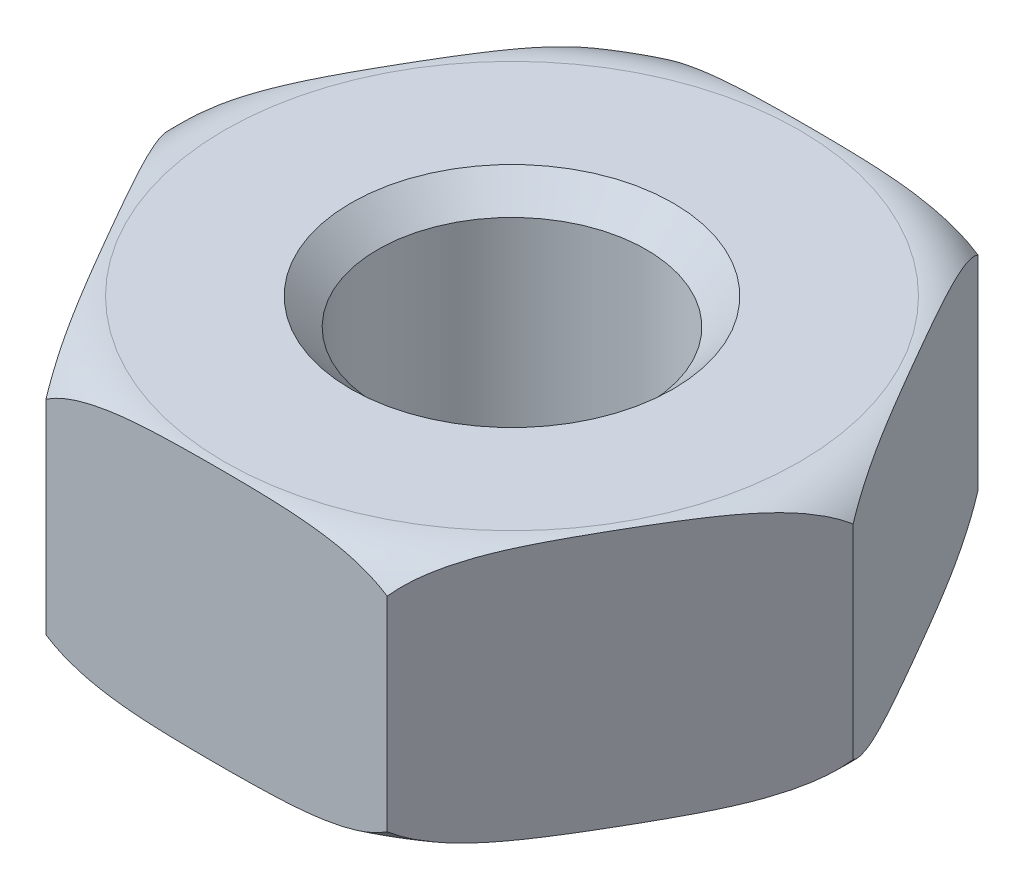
ISO-10303-21;
HEADER;
FILE_DESCRIPTION(('STEP AP214'),'2;1');
FILE_NAME('part.step','',(''),(''),'','','');
FILE_SCHEMA(('AUTOMOTIVE_DESIGN { 1 0 10303 214 1 1 1 1 }'));
ENDSEC;
DATA;
#1=APPLICATION_CONTEXT('core data for automotive mechanical design processes');
#2=APPLICATION_PROTOCOL_DEFINITION('international standard','automotive_design',2000,#1);
#3=PRODUCT_CONTEXT('',#1,'mechanical');
#4=PRODUCT('Part','Part','',(#3));
#5=PRODUCT_RELATED_PRODUCT_CATEGORY('part','',(#4));
#6=PRODUCT_DEFINITION_FORMATION('','',#4);
#7=PRODUCT_DEFINITION_CONTEXT('part definition',#1,'design');
#8=PRODUCT_DEFINITION('design','',#6,#7);
#9=PRODUCT_DEFINITION_SHAPE('','',#8);
#10=(LENGTH_UNIT() NAMED_UNIT(*) SI_UNIT(.MILLI.,.METRE.));
#11=(NAMED_UNIT(*) PLANE_ANGLE_UNIT() SI_UNIT($,.RADIAN.));
#12=(NAMED_UNIT(*) SI_UNIT($,.STERADIAN.) SOLID_ANGLE_UNIT());
#13=UNCERTAINTY_MEASURE_WITH_UNIT(LENGTH_MEASURE(1.E-05),#10,'distance_accuracy_value','');
#14=(GEOMETRIC_REPRESENTATION_CONTEXT(3) GLOBAL_UNCERTAINTY_ASSIGNED_CONTEXT((#13)) GLOBAL_UNIT_ASSIGNED_CONTEXT((#10,
#11,#12)) REPRESENTATION_CONTEXT('',''));
#15=CARTESIAN_POINT('',(0.,0.,0.));
#16=DIRECTION('',(0.,0.,1.));
#17=DIRECTION('',(1.,0.,0.));
#18=AXIS2_PLACEMENT_3D('',#15,#16,#17);
#19=CARTESIAN_POINT('',(-1.58771324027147,2.4,2.75));
#20=DIRECTION('',(0.,0.,-1.));
#21=DIRECTION('',(-1.,0.,0.));
#22=AXIS2_PLACEMENT_3D('',#19,#20,#21);
#23=PLANE('',#22);
#24=CARTESIAN_POINT('',(0.,2.39553508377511,2.75));
#25=CARTESIAN_POINT('',(0.0525652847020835,2.39553542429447,2.75));
#26=CARTESIAN_POINT('',(0.105130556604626,2.39535947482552,2.75));
#27=CARTESIAN_POINT('',(0.210259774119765,2.39459145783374,2.75));
#28=CARTESIAN_POINT('',(0.262823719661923,2.39399937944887,2.75));
#29=CARTESIAN_POINT('',(0.368027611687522,2.39220364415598,2.75));
#30=CARTESIAN_POINT('',(0.420667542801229,2.39099899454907,2.75));
#31=CARTESIAN_POINT('',(0.525917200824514,2.38765708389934,2.75));
#32=CARTESIAN_POINT('',(0.578526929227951,2.38551987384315,2.75));
#33=CARTESIAN_POINT('',(0.683297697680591,2.37988734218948,2.75));
#34=CARTESIAN_POINT('',(0.735459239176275,2.37640191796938,2.75));
#35=CARTESIAN_POINT('',(0.839613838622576,2.36750994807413,2.75));
#36=CARTESIAN_POINT('',(0.891606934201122,2.36210386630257,2.75));
#37=CARTESIAN_POINT('',(0.995106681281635,2.34868444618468,2.75));
#38=CARTESIAN_POINT('',(1.04661433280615,2.3406791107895,2.75));
#39=CARTESIAN_POINT('',(1.14895293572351,2.32118843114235,2.75));
#40=CARTESIAN_POINT('',(1.19978439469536,2.30970587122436,2.75));
#41=CARTESIAN_POINT('',(1.2927992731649,2.28418986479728,2.75));
#42=CARTESIAN_POINT('',(1.33515117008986,2.27078361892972,2.75));
#43=CARTESIAN_POINT('',(1.41844153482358,2.2397337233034,2.75));
#44=CARTESIAN_POINT('',(1.45937616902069,2.22207947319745,2.75));
#45=CARTESIAN_POINT('',(1.53915835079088,2.18123789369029,2.75));
#46=CARTESIAN_POINT('',(1.57796983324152,2.15797840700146,2.75));
#47=CARTESIAN_POINT('',(1.65077571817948,2.10485187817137,2.75));
#48=CARTESIAN_POINT('',(1.68479279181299,2.07501777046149,2.75));
#49=CARTESIAN_POINT('',(1.73024895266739,2.02399113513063,2.75));
#50=CARTESIAN_POINT('',(1.74470513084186,2.00549020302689,2.75));
#51=CARTESIAN_POINT('',(1.77066861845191,1.96649855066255,2.75));
#52=CARTESIAN_POINT('',(1.78217733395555,1.94600878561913,2.75));
#53=CARTESIAN_POINT('',(1.80156432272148,1.90309039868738,2.75));
#54=CARTESIAN_POINT('',(1.80940382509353,1.88064391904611,2.75));
#55=CARTESIAN_POINT('',(1.82053656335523,1.83464862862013,2.75));
#56=CARTESIAN_POINT('',(1.82383508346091,1.81110113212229,2.75));
#57=CARTESIAN_POINT('',(1.82543546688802,1.76686621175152,2.75));
#58=CARTESIAN_POINT('',(1.8243226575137,1.74619834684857,2.75));
#59=CARTESIAN_POINT('',(1.8184846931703,1.70538294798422,2.75));
#60=CARTESIAN_POINT('',(1.81375912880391,1.68523547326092,2.75));
#61=CARTESIAN_POINT('',(1.80130907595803,1.64675830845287,2.75));
#62=CARTESIAN_POINT('',(1.79370601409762,1.62838858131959,2.75));
#63=CARTESIAN_POINT('',(1.77595937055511,1.59293374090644,2.75));
#64=CARTESIAN_POINT('',(1.76581489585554,1.57584908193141,2.75));
#65=CARTESIAN_POINT('',(1.73730405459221,1.53410637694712,2.75));
#66=CARTESIAN_POINT('',(1.71748201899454,1.51044215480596,2.75));
#67=CARTESIAN_POINT('',(1.67435251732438,1.46653837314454,2.75));
#68=CARTESIAN_POINT('',(1.65103595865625,1.44630805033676,2.75));
#69=CARTESIAN_POINT('',(1.58713811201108,1.39764264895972,2.75));
#70=CARTESIAN_POINT('',(1.54467731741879,1.37169477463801,2.75));
#71=CARTESIAN_POINT('',(1.45647260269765,1.32633054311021,2.75));
#72=CARTESIAN_POINT('',(1.41072231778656,1.30692728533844,2.75));
#73=CARTESIAN_POINT('',(1.30390881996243,1.26833206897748,2.75));
#74=CARTESIAN_POINT('',(1.24224812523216,1.2508287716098,2.75));
#75=CARTESIAN_POINT('',(1.11748254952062,1.22187906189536,2.75));
#76=CARTESIAN_POINT('',(1.05437489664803,1.2104455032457,2.75));
#77=CARTESIAN_POINT('',(0.927202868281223,1.19183925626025,2.75));
#78=CARTESIAN_POINT('',(0.863135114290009,1.18469078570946,2.75));
#79=CARTESIAN_POINT('',(0.734809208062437,1.17338153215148,2.75));
#80=CARTESIAN_POINT('',(0.670551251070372,1.16921834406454,2.75));
#81=CARTESIAN_POINT('',(0.534316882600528,1.16244499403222,2.75));
#82=CARTESIAN_POINT('',(0.462329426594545,1.16007775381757,2.75));
#83=CARTESIAN_POINT('',(0.31831393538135,1.15672587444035,2.75));
#84=CARTESIAN_POINT('',(0.246285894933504,1.15574151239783,2.75));
#85=CARTESIAN_POINT('',(0.102523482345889,1.15456617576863,2.75));
#86=CARTESIAN_POINT('',(0.0307891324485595,1.15437192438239,2.75));
#87=CARTESIAN_POINT('',(-0.112672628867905,1.15463130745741,2.75));
#88=CARTESIAN_POINT('',(-0.184400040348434,1.15508488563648,2.75));
#89=CARTESIAN_POINT('',(-0.346551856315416,1.15717916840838,2.75));
#90=CARTESIAN_POINT('',(-0.436972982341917,1.15909866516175,2.75));
#91=CARTESIAN_POINT('',(-0.618018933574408,1.16603730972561,2.75));
#92=CARTESIAN_POINT('',(-0.708643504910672,1.17106618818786,2.75));
#93=CARTESIAN_POINT('',(-0.848192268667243,1.18337899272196,2.75));
#94=CARTESIAN_POINT('',(-0.897291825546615,1.1885896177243,2.75));
#95=CARTESIAN_POINT('',(-0.995176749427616,1.2013708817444,2.75));
#96=CARTESIAN_POINT('',(-1.04396222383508,1.20894066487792,2.75));
#97=CARTESIAN_POINT('',(-1.14076117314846,1.22714002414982,2.75));
#98=CARTESIAN_POINT('',(-1.18877703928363,1.23775653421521,2.75));
#99=CARTESIAN_POINT('',(-1.28373439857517,1.26296394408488,2.75));
#100=CARTESIAN_POINT('',(-1.3306771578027,1.2775498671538,2.75));
#101=CARTESIAN_POINT('',(-1.40936700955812,1.30688241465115,2.75));
#102=CARTESIAN_POINT('',(-1.44158177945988,1.3203620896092,2.75));
#103=CARTESIAN_POINT('',(-1.50460426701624,1.35043462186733,2.75));
#104=CARTESIAN_POINT('',(-1.53541017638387,1.36703134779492,2.75));
#105=CARTESIAN_POINT('',(-1.5950636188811,1.40405052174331,2.75));
#106=CARTESIAN_POINT('',(-1.62389071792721,1.42450649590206,2.75));
#107=CARTESIAN_POINT('',(-1.67798551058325,1.46970063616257,2.75));
#108=CARTESIAN_POINT('',(-1.70326158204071,1.4944284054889,2.75));
#109=CARTESIAN_POINT('',(-1.74069393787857,1.53925806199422,2.75));
#110=CARTESIAN_POINT('',(-1.75438769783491,1.55807021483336,2.75));
#111=CARTESIAN_POINT('',(-1.77870178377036,1.59760595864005,2.75));
#112=CARTESIAN_POINT('',(-1.7893239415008,1.6183284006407,2.75));
#113=CARTESIAN_POINT('',(-1.80682351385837,1.66157037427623,2.75));
#114=CARTESIAN_POINT('',(-1.81366240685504,1.68410580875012,2.75));
#115=CARTESIAN_POINT('',(-1.82276779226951,1.73008275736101,2.75));
#116=CARTESIAN_POINT('',(-1.82503905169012,1.75352330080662,2.75));
#117=CARTESIAN_POINT('',(-1.82479740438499,1.79723803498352,2.75));
#118=CARTESIAN_POINT('',(-1.82288188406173,1.81751777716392,2.75));
#119=CARTESIAN_POINT('',(-1.81561074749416,1.85744636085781,2.75));
#120=CARTESIAN_POINT('',(-1.81025457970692,1.87709510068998,2.75));
#121=CARTESIAN_POINT('',(-1.79659131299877,1.91500919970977,2.75));
#122=CARTESIAN_POINT('',(-1.7883265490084,1.93329006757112,2.75));
#123=CARTESIAN_POINT('',(-1.76931571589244,1.96849918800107,2.75));
#124=CARTESIAN_POINT('',(-1.75856862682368,1.98542688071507,2.75));
#125=CARTESIAN_POINT('',(-1.72812720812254,2.02737710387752,2.75));
#126=CARTESIAN_POINT('',(-1.70689471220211,2.05128419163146,2.75));
#127=CARTESIAN_POINT('',(-1.66094168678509,2.09546510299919,2.75));
#128=CARTESIAN_POINT('',(-1.63621209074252,2.11572916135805,2.75));
#129=CARTESIAN_POINT('',(-1.56800556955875,2.16478104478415,2.75));
#130=CARTESIAN_POINT('',(-1.52257814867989,2.1908343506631,2.75));
#131=CARTESIAN_POINT('',(-1.42846630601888,2.23604292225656,2.75));
#132=CARTESIAN_POINT('',(-1.37977412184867,2.25518100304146,2.75));
#133=CARTESIAN_POINT('',(-1.26236585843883,2.29424115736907,2.75));
#134=CARTESIAN_POINT('',(-1.19289512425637,2.31184315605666,2.75));
#135=CARTESIAN_POINT('',(-1.05253081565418,2.34023594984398,2.75));
#136=CARTESIAN_POINT('',(-0.981634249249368,2.35101044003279,2.75));
#137=CARTESIAN_POINT('',(-0.839060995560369,2.36798123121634,2.75));
#138=CARTESIAN_POINT('',(-0.767382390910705,2.3741604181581,2.75));
#139=CARTESIAN_POINT('',(-0.623918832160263,2.38354931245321,2.75));
#140=CARTESIAN_POINT('',(-0.552134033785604,2.38676171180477,2.75));
#141=CARTESIAN_POINT('',(-0.400302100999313,2.39170979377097,2.75));
#142=CARTESIAN_POINT('',(-0.32024890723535,2.39323458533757,2.75));
#143=CARTESIAN_POINT('',(-0.200156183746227,2.39466345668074,2.75));
#144=CARTESIAN_POINT('',(-0.160119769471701,2.39499668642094,2.75));
#145=CARTESIAN_POINT('',(-0.0800555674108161,2.39543234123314,2.75));
#146=CARTESIAN_POINT('',(-0.0400277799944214,2.39553482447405,2.75));
#147=CARTESIAN_POINT('',(0.,2.39553508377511,2.75));
#148=B_SPLINE_CURVE_WITH_KNOTS('',3,(#24,#25,#26,#27,#28,#29,#30,#31,#32,#33,#34,#35,#36,#37,
#38,#39,#40,#41,#42,#43,#44,#45,#46,#47,#48,#49,#50,#51,#52,#53,#54,#55,#56,#57,#58,#59,#60,#61,
#62,#63,#64,#65,#66,#67,#68,#69,#70,#71,#72,#73,#74,#75,#76,#77,#78,#79,#80,#81,#82,#83,#84,#85,
#86,#87,#88,#89,#90,#91,#92,#93,#94,#95,#96,#97,#98,#99,#100,#101,#102,#103,#104,#105,#106,#107,
#108,#109,#110,#111,#112,#113,#114,#115,#116,#117,#118,#119,#120,#121,#122,#123,#124,#125,#126,
#127,#128,#129,#130,#131,#132,#133,#134,#135,#136,#137,#138,#139,#140,#141,#142,#143,#144,#145,
#146,#147),.UNSPECIFIED.,.T.,.F.,(4,2,2,2,2,2,2,2,2,2,2,2,2,2,2,2,2,2,2,2,2,2,2,2,2,2,2,2,2,2,2,
2,2,2,2,2,2,2,2,2,2,2,2,2,2,2,2,2,2,2,2,2,2,2,2,2,2,2,2,2,2,4),(0.,0.157695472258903,
0.31539506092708,0.473351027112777,0.631298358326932,0.788107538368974,0.94487886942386,
1.1011720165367,1.25734034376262,1.39044420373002,1.52388371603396,1.65914256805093,
1.79373867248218,1.8639595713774,1.93414690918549,2.00506001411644,2.07589052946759,
2.13765818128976,2.19943283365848,2.25884820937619,2.31828449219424,2.41036340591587,
2.50268620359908,2.65112590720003,2.79986098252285,2.99167172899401,3.18388706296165,
3.37717873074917,3.57031449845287,3.78636936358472,4.00246751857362,4.21766853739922,
4.43285086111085,4.70416189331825,4.97632630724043,5.12441102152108,5.2724420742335,
5.41984753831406,5.56706903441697,5.67170453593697,5.77647077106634,5.88219294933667,
5.98766135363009,6.05723587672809,6.12676882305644,6.19699730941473,6.26715246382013,
6.32795568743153,6.38876866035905,6.44873079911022,6.50871761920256,6.604090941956,
6.69971622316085,6.85593075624,7.01253086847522,7.22695758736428,7.4418944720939,
7.65762788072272,7.87316534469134,8.11335179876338,8.23346513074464,8.35354817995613),.UNSPECIFIED.);
#149=CARTESIAN_POINT('',(-1.58771324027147,2.15,2.75));
#150=VERTEX_POINT('',#149);
#151=CARTESIAN_POINT('',(1.58771324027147,2.15,2.75));
#152=VERTEX_POINT('',#151);
#153=EDGE_CURVE('E105',#150,#152,#148,.T.);
#154=ORIENTED_EDGE('',*,*,#153,.F.);
#155=DIRECTION('',(0.,-1.,0.));
#156=VECTOR('',#155,1.);
#157=CARTESIAN_POINT('',(-1.58771324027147,2.4,2.75));
#158=LINE('',#157,#156);
#159=CARTESIAN_POINT('',(-1.58771324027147,0.250000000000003,2.75));
#160=VERTEX_POINT('',#159);
#161=EDGE_CURVE('E70',#150,#160,#158,.T.);
#162=ORIENTED_EDGE('',*,*,#161,.T.);
#163=CARTESIAN_POINT('',(0.,0.00446491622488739,2.75));
#164=CARTESIAN_POINT('',(-0.0525652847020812,0.00446457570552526,2.75));
#165=CARTESIAN_POINT('',(-0.105130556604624,0.00464052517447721,2.75));
#166=CARTESIAN_POINT('',(-0.210259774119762,0.00540854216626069,2.75));
#167=CARTESIAN_POINT('',(-0.26282371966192,0.0060006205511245,2.75));
#168=CARTESIAN_POINT('',(-0.36802761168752,0.00779635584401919,2.75));
#169=CARTESIAN_POINT('',(-0.420667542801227,0.00900100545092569,2.75));
#170=CARTESIAN_POINT('',(-0.525917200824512,0.012342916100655,2.75));
#171=CARTESIAN_POINT('',(-0.578526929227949,0.0144801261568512,2.75));
#172=CARTESIAN_POINT('',(-0.683297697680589,0.0201126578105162,2.75));
#173=CARTESIAN_POINT('',(-0.735459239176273,0.0235980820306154,2.75));
#174=CARTESIAN_POINT('',(-0.839613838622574,0.0324900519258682,2.75));
#175=CARTESIAN_POINT('',(-0.89160693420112,0.0378961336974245,2.75));
#176=CARTESIAN_POINT('',(-0.995106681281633,0.0513155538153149,2.75));
#177=CARTESIAN_POINT('',(-1.04661433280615,0.0593208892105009,2.75));
#178=CARTESIAN_POINT('',(-1.14895293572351,0.0788115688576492,2.75));
#179=CARTESIAN_POINT('',(-1.19978439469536,0.0902941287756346,2.75));
#180=CARTESIAN_POINT('',(-1.2927992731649,0.115810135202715,2.75));
#181=CARTESIAN_POINT('',(-1.33515117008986,0.129216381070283,2.75));
#182=CARTESIAN_POINT('',(-1.41844153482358,0.1602662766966,2.75));
#183=CARTESIAN_POINT('',(-1.45937616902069,0.177920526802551,2.75));
#184=CARTESIAN_POINT('',(-1.53915835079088,0.218762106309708,2.75));
#185=CARTESIAN_POINT('',(-1.57796983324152,0.242021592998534,2.75));
#186=CARTESIAN_POINT('',(-1.65077571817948,0.295148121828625,2.75));
#187=CARTESIAN_POINT('',(-1.68479279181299,0.324982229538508,2.75));
#188=CARTESIAN_POINT('',(-1.73024895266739,0.376008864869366,2.75));
#189=CARTESIAN_POINT('',(-1.74470513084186,0.394509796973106,2.75));
#190=CARTESIAN_POINT('',(-1.7706686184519,0.433501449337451,2.75));
#191=CARTESIAN_POINT('',(-1.78217733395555,0.453991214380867,2.75));
#192=CARTESIAN_POINT('',(-1.80156432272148,0.496909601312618,2.75));
#193=CARTESIAN_POINT('',(-1.80940382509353,0.519356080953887,2.75));
#194=CARTESIAN_POINT('',(-1.82053656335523,0.565351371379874,2.75));
#195=CARTESIAN_POINT('',(-1.82383508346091,0.588898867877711,2.75));
#196=CARTESIAN_POINT('',(-1.82543546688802,0.633133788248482,2.75));
#197=CARTESIAN_POINT('',(-1.8243226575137,0.653801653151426,2.75));
#198=CARTESIAN_POINT('',(-1.8184846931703,0.694617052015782,2.75));
#199=CARTESIAN_POINT('',(-1.81375912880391,0.714764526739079,2.75));
#200=CARTESIAN_POINT('',(-1.80130907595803,0.753241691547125,2.75));
#201=CARTESIAN_POINT('',(-1.79370601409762,0.771611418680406,2.75));
#202=CARTESIAN_POINT('',(-1.77595937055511,0.807066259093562,2.75));
#203=CARTESIAN_POINT('',(-1.76581489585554,0.824150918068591,2.75));
#204=CARTESIAN_POINT('',(-1.73730405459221,0.865893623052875,2.75));
#205=CARTESIAN_POINT('',(-1.71748201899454,0.889557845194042,2.75));
#206=CARTESIAN_POINT('',(-1.67435251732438,0.933461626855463,2.75));
#207=CARTESIAN_POINT('',(-1.65103595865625,0.953691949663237,2.75));
#208=CARTESIAN_POINT('',(-1.58713811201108,1.00235735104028,2.75));
#209=CARTESIAN_POINT('',(-1.54467731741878,1.02830522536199,2.75));
#210=CARTESIAN_POINT('',(-1.45647260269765,1.07366945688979,2.75));
#211=CARTESIAN_POINT('',(-1.41072231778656,1.09307271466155,2.75));
#212=CARTESIAN_POINT('',(-1.30390881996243,1.13166793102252,2.75));
#213=CARTESIAN_POINT('',(-1.24224812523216,1.1491712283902,2.75));
#214=CARTESIAN_POINT('',(-1.11748254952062,1.17812093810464,2.75));
#215=CARTESIAN_POINT('',(-1.05437489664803,1.18955449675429,2.75));
#216=CARTESIAN_POINT('',(-0.92720286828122,1.20816074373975,2.75));
#217=CARTESIAN_POINT('',(-0.863135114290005,1.21530921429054,2.75));
#218=CARTESIAN_POINT('',(-0.734809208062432,1.22661846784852,2.75));
#219=CARTESIAN_POINT('',(-0.670551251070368,1.23078165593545,2.75));
#220=CARTESIAN_POINT('',(-0.534316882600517,1.23755500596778,2.75));
#221=CARTESIAN_POINT('',(-0.462329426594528,1.23992224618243,2.75));
#222=CARTESIAN_POINT('',(-0.318313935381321,1.24327412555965,2.75));
#223=CARTESIAN_POINT('',(-0.246285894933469,1.24425848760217,2.75));
#224=CARTESIAN_POINT('',(-0.102523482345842,1.24543382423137,2.75));
#225=CARTESIAN_POINT('',(-0.0307891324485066,1.24562807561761,2.75));
#226=CARTESIAN_POINT('',(0.11267262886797,1.24536869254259,2.75));
#227=CARTESIAN_POINT('',(0.184400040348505,1.24491511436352,2.75));
#228=CARTESIAN_POINT('',(0.346551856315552,1.24282083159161,2.75));
#229=CARTESIAN_POINT('',(0.436972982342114,1.24090133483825,2.75));
#230=CARTESIAN_POINT('',(0.618018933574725,1.23396269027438,2.75));
#231=CARTESIAN_POINT('',(0.708643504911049,1.22893381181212,2.75));
#232=CARTESIAN_POINT('',(0.8481922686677,1.21662100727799,2.75));
#233=CARTESIAN_POINT('',(0.89729182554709,1.21141038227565,2.75));
#234=CARTESIAN_POINT('',(0.995176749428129,1.19862911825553,2.75));
#235=CARTESIAN_POINT('',(1.04396222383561,1.191059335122,2.75));
#236=CARTESIAN_POINT('',(1.14076117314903,1.17285997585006,2.75));
#237=CARTESIAN_POINT('',(1.18877703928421,1.16224346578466,2.75));
#238=CARTESIAN_POINT('',(1.28373439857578,1.13703605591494,2.75));
#239=CARTESIAN_POINT('',(1.33067715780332,1.122450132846,2.75));
#240=CARTESIAN_POINT('',(1.40936700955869,1.09311758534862,2.75));
#241=CARTESIAN_POINT('',(1.44158177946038,1.07963791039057,2.75));
#242=CARTESIAN_POINT('',(1.50460426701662,1.04956537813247,2.75));
#243=CARTESIAN_POINT('',(1.53541017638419,1.0329686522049,2.75));
#244=CARTESIAN_POINT('',(1.5950636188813,0.995949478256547,2.75));
#245=CARTESIAN_POINT('',(1.62389071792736,0.975493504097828,2.75));
#246=CARTESIAN_POINT('',(1.67798551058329,0.930299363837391,2.75));
#247=CARTESIAN_POINT('',(1.7032615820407,0.905571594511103,2.75));
#248=CARTESIAN_POINT('',(1.74069393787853,0.860741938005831,2.75));
#249=CARTESIAN_POINT('',(1.75438769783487,0.841929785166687,2.75));
#250=CARTESIAN_POINT('',(1.77870178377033,0.802394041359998,2.75));
#251=CARTESIAN_POINT('',(1.78932394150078,0.781671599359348,2.75));
#252=CARTESIAN_POINT('',(1.80682351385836,0.73842962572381,2.75));
#253=CARTESIAN_POINT('',(1.81366240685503,0.715894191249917,2.75));
#254=CARTESIAN_POINT('',(1.82276779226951,0.669917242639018,2.75));
#255=CARTESIAN_POINT('',(1.82503905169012,0.646476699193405,2.75));
#256=CARTESIAN_POINT('',(1.82479740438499,0.602761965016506,2.75));
#257=CARTESIAN_POINT('',(1.82288188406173,0.582482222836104,2.75));
#258=CARTESIAN_POINT('',(1.81561074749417,0.542553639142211,2.75));
#259=CARTESIAN_POINT('',(1.81025457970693,0.522904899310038,2.75));
#260=CARTESIAN_POINT('',(1.79659131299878,0.484990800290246,2.75));
#261=CARTESIAN_POINT('',(1.7883265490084,0.466709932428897,2.75));
#262=CARTESIAN_POINT('',(1.76931571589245,0.431500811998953,2.75));
#263=CARTESIAN_POINT('',(1.75856862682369,0.414573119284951,2.75));
#264=CARTESIAN_POINT('',(1.72812720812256,0.372622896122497,2.75));
#265=CARTESIAN_POINT('',(1.70689471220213,0.348715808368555,2.75));
#266=CARTESIAN_POINT('',(1.66094168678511,0.304534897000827,2.75));
#267=CARTESIAN_POINT('',(1.63621209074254,0.284270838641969,2.75));
#268=CARTESIAN_POINT('',(1.56800556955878,0.235218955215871,2.75));
#269=CARTESIAN_POINT('',(1.52257814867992,0.209165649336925,2.75));
#270=CARTESIAN_POINT('',(1.42846630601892,0.163957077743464,2.75));
#271=CARTESIAN_POINT('',(1.37977412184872,0.144818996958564,2.75));
#272=CARTESIAN_POINT('',(1.2623658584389,0.10575884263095,2.75));
#273=CARTESIAN_POINT('',(1.19289512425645,0.0881568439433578,2.75));
#274=CARTESIAN_POINT('',(1.05253081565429,0.0597640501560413,2.75));
#275=CARTESIAN_POINT('',(0.981634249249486,0.0489895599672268,2.75));
#276=CARTESIAN_POINT('',(0.839060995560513,0.0320187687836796,2.75));
#277=CARTESIAN_POINT('',(0.767382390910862,0.0258395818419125,2.75));
#278=CARTESIAN_POINT('',(0.623918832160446,0.016450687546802,2.75));
#279=CARTESIAN_POINT('',(0.5521340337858,0.0132382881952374,2.75));
#280=CARTESIAN_POINT('',(0.400302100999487,0.00829020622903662,2.75));
#281=CARTESIAN_POINT('',(0.32024890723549,0.00676541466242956,2.75));
#282=CARTESIAN_POINT('',(0.200156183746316,0.00533654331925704,2.75));
#283=CARTESIAN_POINT('',(0.160119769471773,0.00500331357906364,2.75));
#284=CARTESIAN_POINT('',(0.0800555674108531,0.00456765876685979,2.75));
#285=CARTESIAN_POINT('',(0.040027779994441,0.00446517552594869,2.75));
#286=CARTESIAN_POINT('',(0.,0.00446491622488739,2.75));
#287=B_SPLINE_CURVE_WITH_KNOTS('',3,(#163,#164,#165,#166,#167,#168,#169,#170,#171,#172,#173,
#174,#175,#176,#177,#178,#179,#180,#181,#182,#183,#184,#185,#186,#187,#188,#189,#190,#191,#192,
#193,#194,#195,#196,#197,#198,#199,#200,#201,#202,#203,#204,#205,#206,#207,#208,#209,#210,#211,
#212,#213,#214,#215,#216,#217,#218,#219,#220,#221,#222,#223,#224,#225,#226,#227,#228,#229,#230,
#231,#232,#233,#234,#235,#236,#237,#238,#239,#240,#241,#242,#243,#244,#245,#246,#247,#248,#249,
#250,#251,#252,#253,#254,#255,#256,#257,#258,#259,#260,#261,#262,#263,#264,#265,#266,#267,#268,
#269,#270,#271,#272,#273,#274,#275,#276,#277,#278,#279,#280,#281,#282,#283,#284,#285,#286),
.UNSPECIFIED.,.T.,.F.,(4,2,2,2,2,2,2,2,2,2,2,2,2,2,2,2,2,2,2,2,2,2,2,2,2,2,2,2,2,2,2,2,2,2,2,2,
2,2,2,2,2,2,2,2,2,2,2,2,2,2,2,2,2,2,2,2,2,2,2,2,2,4),(0.,0.157695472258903,0.31539506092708,
0.473351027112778,0.631298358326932,0.788107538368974,0.94487886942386,1.1011720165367,
1.25734034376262,1.39044420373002,1.52388371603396,1.65914256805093,1.79373867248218,
1.86395957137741,1.93414690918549,2.00506001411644,2.07589052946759,2.13765818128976,
2.19943283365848,2.25884820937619,2.31828449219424,2.41036340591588,2.50268620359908,
2.65112590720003,2.79986098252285,2.99167172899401,3.18388706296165,3.37717873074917,
3.57031449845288,3.78636936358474,4.00246751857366,4.21766853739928,4.43285086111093,
4.70416189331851,4.97632630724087,5.12441102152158,5.27244207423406,5.41984753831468,
5.56706903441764,5.67170453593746,5.77647077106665,5.88219294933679,5.98766135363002,
6.05723587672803,6.1267688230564,6.1969973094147,6.26715246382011,6.32795568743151,
6.38876866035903,6.4487307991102,6.50871761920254,6.60409094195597,6.69971622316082,
6.85593075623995,7.01253086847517,7.22695758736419,7.44189447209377,7.65762788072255,
7.87316534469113,8.11335179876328,8.23346513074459,8.35354817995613),.UNSPECIFIED.);
#288=CARTESIAN_POINT('',(1.58771324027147,0.250000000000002,2.75));
#289=VERTEX_POINT('',#288);
#290=EDGE_CURVE('E267',#289,#160,#287,.T.);
#291=ORIENTED_EDGE('',*,*,#290,.F.);
#292=DIRECTION('',(0.,-1.,0.));
#293=VECTOR('',#292,1.);
#294=CARTESIAN_POINT('',(1.58771324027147,2.4,2.75));
#295=LINE('',#294,#293);
#296=EDGE_CURVE('E126',#152,#289,#295,.T.);
#297=ORIENTED_EDGE('',*,*,#296,.F.);
#298=EDGE_LOOP('',(#154,#162,#291,#297));
#299=FACE_BOUND('',#298,.T.);
#300=ADVANCED_FACE('F45',(#299),#23,.F.);
#301=CARTESIAN_POINT('',(1.58771324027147,2.4,2.75));
#302=DIRECTION('',(-0.866025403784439,0.,-0.5));
#303=DIRECTION('',(-0.5,0.,0.866025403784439));
#304=AXIS2_PLACEMENT_3D('',#301,#302,#303);
#305=PLANE('',#304);
#306=CARTESIAN_POINT('',(1.5875977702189,2.14984598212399,2.75019999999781));
#307=CARTESIAN_POINT('',(1.59871866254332,2.16466916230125,2.7309380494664));
#308=CARTESIAN_POINT('',(1.61018659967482,2.17838058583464,2.71107499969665));
#309=CARTESIAN_POINT('',(1.63363440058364,2.20380279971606,2.6704622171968));
#310=CARTESIAN_POINT('',(1.64561308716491,2.21551790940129,2.6497145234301));
#311=CARTESIAN_POINT('',(1.68175778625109,2.24776849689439,2.58711006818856));
#312=CARTESIAN_POINT('',(1.70647124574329,2.26583256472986,2.54430510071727));
#313=CARTESIAN_POINT('',(1.7692463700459,2.30467053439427,2.4355753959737));
#314=CARTESIAN_POINT('',(1.80778066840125,2.32225218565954,2.3688320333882));
#315=CARTESIAN_POINT('',(1.88553848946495,2.34991270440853,2.23415153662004));
#316=CARTESIAN_POINT('',(1.92476341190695,2.35997394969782,2.16621197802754));
#317=CARTESIAN_POINT('',(2.0040311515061,2.37540283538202,2.02891622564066));
#318=CARTESIAN_POINT('',(2.04407728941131,2.38069616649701,1.95955428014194));
#319=CARTESIAN_POINT('',(2.12418702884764,2.38837154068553,1.82080014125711));
#320=CARTESIAN_POINT('',(2.16425057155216,2.39075652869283,1.75140804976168));
#321=CARTESIAN_POINT('',(2.25116256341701,2.39426753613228,1.60087206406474));
#322=CARTESIAN_POINT('',(2.29801333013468,2.3951126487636,1.51972415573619));
#323=CARTESIAN_POINT('',(2.39173529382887,2.39572061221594,1.35739295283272));
#324=CARTESIAN_POINT('',(2.43860649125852,2.39548301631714,1.27620965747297));
#325=CARTESIAN_POINT('',(2.532190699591,2.3936050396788,1.11411705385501));
#326=CARTESIAN_POINT('',(2.57890373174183,2.39196919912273,1.03320770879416));
#327=CARTESIAN_POINT('',(2.67227439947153,2.38572541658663,0.871484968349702));
#328=CARTESIAN_POINT('',(2.71893205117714,2.38111900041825,0.790671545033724));
#329=CARTESIAN_POINT('',(2.78935596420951,2.36973317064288,0.668693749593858));
#330=CARTESIAN_POINT('',(2.8132052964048,2.36510429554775,0.627385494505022));
#331=CARTESIAN_POINT('',(2.86077769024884,2.35376932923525,0.544987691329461));
#332=CARTESIAN_POINT('',(2.88450078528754,2.34706381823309,0.503898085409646));
#333=CARTESIAN_POINT('',(2.93156464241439,2.33099013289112,0.422381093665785));
#334=CARTESIAN_POINT('',(2.95490690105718,2.32164009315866,0.381951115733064));
#335=CARTESIAN_POINT('',(3.00117256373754,2.29948880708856,0.301816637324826));
#336=CARTESIAN_POINT('',(3.02409621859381,2.2866897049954,0.262111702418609));
#337=CARTESIAN_POINT('',(3.06915492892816,2.25671650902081,0.184067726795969));
#338=CARTESIAN_POINT('',(3.0912925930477,2.23955881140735,0.145724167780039));
#339=CARTESIAN_POINT('',(3.12364316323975,2.20954421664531,0.0896913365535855));
#340=CARTESIAN_POINT('',(3.13433603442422,2.19876059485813,0.0711707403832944));
#341=CARTESIAN_POINT('',(3.15529466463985,2.17556782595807,0.034869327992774));
#342=CARTESIAN_POINT('',(3.16555962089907,2.16315579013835,0.0170899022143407));
#343=CARTESIAN_POINT('',(3.17554195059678,2.14984598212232,-0.000200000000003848));
#344=B_SPLINE_CURVE_WITH_KNOTS('',3,(#306,#307,#308,#309,#310,#311,#312,#313,#314,#315,#316,
#317,#318,#319,#320,#321,#322,#323,#324,#325,#326,#327,#328,#329,#330,#331,#332,#333,#334,#335,
#336,#337,#338,#339,#340,#341,#342,#343),.UNSPECIFIED.,.F.,.F.,(4,2,2,2,2,2,2,2,2,2,2,2,2,2,2,2,
2,2,4),(0.,0.0800958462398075,0.160016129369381,0.317484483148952,0.554005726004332,
0.791079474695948,1.03178717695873,1.27225094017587,1.55335581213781,1.83457667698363,
2.11488785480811,2.39505516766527,2.53878984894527,2.68248440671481,2.82521653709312,
2.96786013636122,3.1099748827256,3.18176404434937,3.25368232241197),.UNSPECIFIED.);
#345=CARTESIAN_POINT('',(3.17542648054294,2.15,0.));
#346=VERTEX_POINT('',#345);
#347=EDGE_CURVE('E100',#152,#346,#344,.T.);
#348=ORIENTED_EDGE('',*,*,#347,.F.);
#349=ORIENTED_EDGE('',*,*,#296,.T.);
#350=CARTESIAN_POINT('',(3.17554195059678,0.250154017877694,-0.000200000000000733));
#351=CARTESIAN_POINT('',(3.16442105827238,0.235330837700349,0.0190619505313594));
#352=CARTESIAN_POINT('',(3.1529531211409,0.221619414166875,0.0389250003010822));
#353=CARTESIAN_POINT('',(3.12950532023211,0.196197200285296,0.0795377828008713));
#354=CARTESIAN_POINT('',(3.11752663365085,0.184482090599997,0.100285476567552));
#355=CARTESIAN_POINT('',(3.08138193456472,0.152231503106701,0.162889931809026));
#356=CARTESIAN_POINT('',(3.05666847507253,0.134167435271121,0.205694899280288));
#357=CARTESIAN_POINT('',(2.99389335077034,0.0953294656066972,0.314424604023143));
#358=CARTESIAN_POINT('',(2.95535905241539,0.0777478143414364,0.381167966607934));
#359=CARTESIAN_POINT('',(2.87760123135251,0.0500872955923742,0.515848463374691));
#360=CARTESIAN_POINT('',(2.83837630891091,0.0400260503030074,0.583788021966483));
#361=CARTESIAN_POINT('',(2.75910856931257,0.0245971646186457,0.721083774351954));
#362=CARTESIAN_POINT('',(2.71906243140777,0.0193038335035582,0.790445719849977));
#363=CARTESIAN_POINT('',(2.63895269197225,0.0116284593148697,0.9291998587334));
#364=CARTESIAN_POINT('',(2.59888914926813,0.00924347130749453,0.998591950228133));
#365=CARTESIAN_POINT('',(2.51197715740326,0.00573246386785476,1.14912793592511));
#366=CARTESIAN_POINT('',(2.46512639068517,0.00488735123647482,1.23027584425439));
#367=CARTESIAN_POINT('',(2.37140442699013,0.00427938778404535,1.39260704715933));
#368=CARTESIAN_POINT('',(2.32453322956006,0.0045169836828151,1.47379034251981));
#369=CARTESIAN_POINT('',(2.23094902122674,0.00639496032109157,1.63588294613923));
#370=CARTESIAN_POINT('',(2.18423598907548,0.00803080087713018,1.71679229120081));
#371=CARTESIAN_POINT('',(2.09086532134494,0.0142745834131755,1.87851503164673));
#372=CARTESIAN_POINT('',(2.04420766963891,0.0188809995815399,1.95932845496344));
#373=CARTESIAN_POINT('',(1.97378375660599,0.0302668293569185,2.08130625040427));
#374=CARTESIAN_POINT('',(1.94993442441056,0.0348957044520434,2.12261450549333));
#375=CARTESIAN_POINT('',(1.90236203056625,0.0462306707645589,2.20501230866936));
#376=CARTESIAN_POINT('',(1.87863893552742,0.052936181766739,2.2461019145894));
#377=CARTESIAN_POINT('',(1.83157507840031,0.0690098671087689,2.32761890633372));
#378=CARTESIAN_POINT('',(1.80823281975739,0.0783599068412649,2.36804888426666));
#379=CARTESIAN_POINT('',(1.76196715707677,0.100511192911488,2.44818336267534));
#380=CARTESIAN_POINT('',(1.73904350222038,0.113310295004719,2.48788829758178));
#381=CARTESIAN_POINT('',(1.6939847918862,0.14328349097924,2.56593227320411));
#382=CARTESIAN_POINT('',(1.67184712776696,0.160441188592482,2.60427583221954));
#383=CARTESIAN_POINT('',(1.63949655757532,0.19045578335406,2.66030866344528));
#384=CARTESIAN_POINT('',(1.62880368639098,0.201239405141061,2.67882925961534));
#385=CARTESIAN_POINT('',(1.6078450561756,0.224432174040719,2.71513067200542));
#386=CARTESIAN_POINT('',(1.5975800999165,0.236844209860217,2.73291009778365));
#387=CARTESIAN_POINT('',(1.5875977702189,0.250154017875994,2.75019999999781));
#388=B_SPLINE_CURVE_WITH_KNOTS('',3,(#350,#351,#352,#353,#354,#355,#356,#357,#358,#359,#360,
#361,#362,#363,#364,#365,#366,#367,#368,#369,#370,#371,#372,#373,#374,#375,#376,#377,#378,#379,
#380,#381,#382,#383,#384,#385,#386,#387),.UNSPECIFIED.,.F.,.F.,(4,2,2,2,2,2,2,2,2,2,2,2,2,2,2,2,
2,2,4),(0.,0.0800958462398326,0.160016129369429,0.317484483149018,0.554005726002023,
0.791079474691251,1.03178717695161,1.27225094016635,1.55335581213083,1.83457667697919,
2.11488785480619,2.39505516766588,2.53878984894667,2.68248440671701,2.8252165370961,
2.96786013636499,3.10997488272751,3.18176404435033,3.25368232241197),.UNSPECIFIED.);
#389=CARTESIAN_POINT('',(3.17542648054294,0.250000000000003,0.));
#390=VERTEX_POINT('',#389);
#391=EDGE_CURVE('E124',#390,#289,#388,.T.);
#392=ORIENTED_EDGE('',*,*,#391,.F.);
#393=DIRECTION('',(0.,-1.,0.));
#394=VECTOR('',#393,1.);
#395=CARTESIAN_POINT('',(3.17542648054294,2.4,0.));
#396=LINE('',#395,#394);
#397=EDGE_CURVE('E115',#346,#390,#396,.T.);
#398=ORIENTED_EDGE('',*,*,#397,.F.);
#399=EDGE_LOOP('',(#348,#349,#392,#398));
#400=FACE_BOUND('',#399,.T.);
#401=ADVANCED_FACE('F122',(#400),#305,.F.);
#402=CARTESIAN_POINT('',(3.17542648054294,2.4,0.));
#403=DIRECTION('',(-0.866025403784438,0.,0.5));
#404=DIRECTION('',(0.5,0.,0.866025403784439));
#405=AXIS2_PLACEMENT_3D('',#402,#403,#404);
#406=PLANE('',#405);
#407=CARTESIAN_POINT('',(3.17554195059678,2.1498459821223,0.000199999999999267));
#408=CARTESIAN_POINT('',(3.16442105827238,2.16466916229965,-0.0190619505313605));
#409=CARTESIAN_POINT('',(3.1529531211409,2.17838058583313,-0.0389250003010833));
#410=CARTESIAN_POINT('',(3.12950532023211,2.2038027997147,-0.0795377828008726));
#411=CARTESIAN_POINT('',(3.11752663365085,2.2155179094,-0.100285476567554));
#412=CARTESIAN_POINT('',(3.08138193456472,2.2477684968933,-0.162889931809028));
#413=CARTESIAN_POINT('',(3.05666847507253,2.26583256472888,-0.205694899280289));
#414=CARTESIAN_POINT('',(2.99389335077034,2.3046705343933,-0.314424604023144));
#415=CARTESIAN_POINT('',(2.95535905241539,2.32225218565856,-0.381167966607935));
#416=CARTESIAN_POINT('',(2.87760123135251,2.34991270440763,-0.515848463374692));
#417=CARTESIAN_POINT('',(2.83837630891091,2.35997394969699,-0.583788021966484));
#418=CARTESIAN_POINT('',(2.75910856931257,2.37540283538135,-0.721083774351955));
#419=CARTESIAN_POINT('',(2.71906243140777,2.38069616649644,-0.790445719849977));
#420=CARTESIAN_POINT('',(2.63895269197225,2.38837154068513,-0.9291998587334));
#421=CARTESIAN_POINT('',(2.59888914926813,2.3907565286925,-0.998591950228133));
#422=CARTESIAN_POINT('',(2.51197715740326,2.39426753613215,-1.14912793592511));
#423=CARTESIAN_POINT('',(2.46512639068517,2.39511264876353,-1.2302758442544));
#424=CARTESIAN_POINT('',(2.37140442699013,2.39572061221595,-1.39260704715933));
#425=CARTESIAN_POINT('',(2.32453322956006,2.39548301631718,-1.47379034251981));
#426=CARTESIAN_POINT('',(2.23094902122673,2.39360503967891,-1.63588294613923));
#427=CARTESIAN_POINT('',(2.18423598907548,2.39196919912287,-1.71679229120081));
#428=CARTESIAN_POINT('',(2.09086532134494,2.38572541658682,-1.87851503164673));
#429=CARTESIAN_POINT('',(2.0442076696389,2.38111900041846,-1.95932845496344));
#430=CARTESIAN_POINT('',(1.97378375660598,2.36973317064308,-2.08130625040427));
#431=CARTESIAN_POINT('',(1.94993442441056,2.36510429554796,-2.12261450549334));
#432=CARTESIAN_POINT('',(1.90236203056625,2.35376932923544,-2.20501230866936));
#433=CARTESIAN_POINT('',(1.87863893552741,2.34706381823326,-2.24610191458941));
#434=CARTESIAN_POINT('',(1.8315750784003,2.33099013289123,-2.32761890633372));
#435=CARTESIAN_POINT('',(1.80823281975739,2.32164009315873,-2.36804888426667));
#436=CARTESIAN_POINT('',(1.76196715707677,2.29948880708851,-2.44818336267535));
#437=CARTESIAN_POINT('',(1.73904350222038,2.28668970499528,-2.48788829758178));
#438=CARTESIAN_POINT('',(1.6939847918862,2.25671650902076,-2.56593227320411));
#439=CARTESIAN_POINT('',(1.67184712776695,2.23955881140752,-2.60427583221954));
#440=CARTESIAN_POINT('',(1.63949655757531,2.20954421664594,-2.66030866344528));
#441=CARTESIAN_POINT('',(1.62880368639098,2.19876059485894,-2.67882925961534));
#442=CARTESIAN_POINT('',(1.6078450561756,2.17556782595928,-2.71513067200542));
#443=CARTESIAN_POINT('',(1.5975800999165,2.16315579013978,-2.73291009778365));
#444=CARTESIAN_POINT('',(1.5875977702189,2.14984598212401,-2.75019999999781));
#445=B_SPLINE_CURVE_WITH_KNOTS('',3,(#407,#408,#409,#410,#411,#412,#413,#414,#415,#416,#417,
#418,#419,#420,#421,#422,#423,#424,#425,#426,#427,#428,#429,#430,#431,#432,#433,#434,#435,#436,
#437,#438,#439,#440,#441,#442,#443,#444),.UNSPECIFIED.,.F.,.F.,(4,2,2,2,2,2,2,2,2,2,2,2,2,2,2,2,
2,2,4),(0.,0.0800958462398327,0.160016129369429,0.317484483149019,0.554005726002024,
0.79107947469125,1.03178717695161,1.27225094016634,1.55335581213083,1.83457667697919,
2.1148878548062,2.39505516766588,2.53878984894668,2.68248440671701,2.82521653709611,
2.96786013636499,3.10997488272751,3.18176404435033,3.25368232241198),.UNSPECIFIED.);
#446=CARTESIAN_POINT('',(1.58771324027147,2.15,-2.75));
#447=VERTEX_POINT('',#446);
#448=EDGE_CURVE('E103',#346,#447,#445,.T.);
#449=ORIENTED_EDGE('',*,*,#448,.F.);
#450=ORIENTED_EDGE('',*,*,#397,.T.);
#451=CARTESIAN_POINT('',(1.5875977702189,0.250154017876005,-2.75019999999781));
#452=CARTESIAN_POINT('',(1.59871866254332,0.235330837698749,-2.7309380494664));
#453=CARTESIAN_POINT('',(1.61018659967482,0.221619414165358,-2.71107499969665));
#454=CARTESIAN_POINT('',(1.63363440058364,0.196197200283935,-2.6704622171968));
#455=CARTESIAN_POINT('',(1.64561308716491,0.184482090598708,-2.6497145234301));
#456=CARTESIAN_POINT('',(1.68175778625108,0.152231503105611,-2.58711006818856));
#457=CARTESIAN_POINT('',(1.70647124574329,0.134167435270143,-2.54430510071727));
#458=CARTESIAN_POINT('',(1.76924637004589,0.0953294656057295,-2.4355753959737));
#459=CARTESIAN_POINT('',(1.80778066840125,0.077747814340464,-2.3688320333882));
#460=CARTESIAN_POINT('',(1.88553848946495,0.0500872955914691,-2.23415153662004));
#461=CARTESIAN_POINT('',(1.92476341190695,0.0400260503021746,-2.16621197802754));
#462=CARTESIAN_POINT('',(2.0040311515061,0.0245971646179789,-2.02891622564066));
#463=CARTESIAN_POINT('',(2.04407728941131,0.0193038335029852,-1.95955428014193));
#464=CARTESIAN_POINT('',(2.12418702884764,0.0116284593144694,-1.82080014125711));
#465=CARTESIAN_POINT('',(2.16425057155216,0.00924347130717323,-1.75140804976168));
#466=CARTESIAN_POINT('',(2.25116256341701,0.00573246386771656,-1.60087206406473));
#467=CARTESIAN_POINT('',(2.29801333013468,0.00488735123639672,-1.51972415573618));
#468=CARTESIAN_POINT('',(2.39173529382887,0.00427938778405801,-1.35739295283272));
#469=CARTESIAN_POINT('',(2.43860649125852,0.0045169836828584,-1.27620965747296));
#470=CARTESIAN_POINT('',(2.532190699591,0.00639496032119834,-1.11411705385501));
#471=CARTESIAN_POINT('',(2.57890373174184,0.00803080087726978,-1.03320770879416));
#472=CARTESIAN_POINT('',(2.67227439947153,0.0142745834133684,-0.8714849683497));
#473=CARTESIAN_POINT('',(2.71893205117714,0.0188809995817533,-0.790671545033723));
#474=CARTESIAN_POINT('',(2.78935596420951,0.0302668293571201,-0.668693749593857));
#475=CARTESIAN_POINT('',(2.8132052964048,0.0348957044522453,-0.627385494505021));
#476=CARTESIAN_POINT('',(2.86077769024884,0.0462306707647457,-0.54498769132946));
#477=CARTESIAN_POINT('',(2.88450078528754,0.0529361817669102,-0.503898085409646));
#478=CARTESIAN_POINT('',(2.93156464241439,0.0690098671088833,-0.422381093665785));
#479=CARTESIAN_POINT('',(2.95490690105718,0.0783599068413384,-0.381951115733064));
#480=CARTESIAN_POINT('',(3.00117256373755,0.100511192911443,-0.301816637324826));
#481=CARTESIAN_POINT('',(3.02409621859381,0.113310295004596,-0.262111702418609));
#482=CARTESIAN_POINT('',(3.06915492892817,0.143283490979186,-0.18406772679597));
#483=CARTESIAN_POINT('',(3.0912925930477,0.160441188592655,-0.14572416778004));
#484=CARTESIAN_POINT('',(3.12364316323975,0.190455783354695,-0.0896913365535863));
#485=CARTESIAN_POINT('',(3.13433603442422,0.201239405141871,-0.0711707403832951));
#486=CARTESIAN_POINT('',(3.15529466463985,0.22443217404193,-0.0348693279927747));
#487=CARTESIAN_POINT('',(3.16555962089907,0.236844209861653,-0.0170899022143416));
#488=CARTESIAN_POINT('',(3.17554195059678,0.250154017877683,0.000200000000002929));
#489=B_SPLINE_CURVE_WITH_KNOTS('',3,(#451,#452,#453,#454,#455,#456,#457,#458,#459,#460,#461,
#462,#463,#464,#465,#466,#467,#468,#469,#470,#471,#472,#473,#474,#475,#476,#477,#478,#479,#480,
#481,#482,#483,#484,#485,#486,#487,#488),.UNSPECIFIED.,.F.,.F.,(4,2,2,2,2,2,2,2,2,2,2,2,2,2,2,2,
2,2,4),(0.,0.0800958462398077,0.160016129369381,0.317484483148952,0.554005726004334,
0.791079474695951,1.03178717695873,1.27225094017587,1.55335581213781,1.83457667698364,
2.11488785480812,2.39505516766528,2.53878984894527,2.68248440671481,2.82521653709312,
2.96786013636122,3.1099748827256,3.18176404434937,3.25368232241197),.UNSPECIFIED.);
#490=CARTESIAN_POINT('',(1.58771324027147,0.250000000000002,-2.75));
#491=VERTEX_POINT('',#490);
#492=EDGE_CURVE('E262',#491,#390,#489,.T.);
#493=ORIENTED_EDGE('',*,*,#492,.F.);
#494=DIRECTION('',(0.,-1.,0.));
#495=VECTOR('',#494,1.);
#496=CARTESIAN_POINT('',(1.58771324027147,2.4,-2.75));
#497=LINE('',#496,#495);
#498=EDGE_CURVE('E117',#447,#491,#497,.T.);
#499=ORIENTED_EDGE('',*,*,#498,.F.);
#500=EDGE_LOOP('',(#449,#450,#493,#499));
#501=FACE_BOUND('',#500,.T.);
#502=ADVANCED_FACE('F113',(#501),#406,.F.);
#503=CARTESIAN_POINT('',(1.58771324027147,2.4,-2.75));
#504=DIRECTION('',(0.,0.,1.));
#505=DIRECTION('',(1.,0.,0.));
#506=AXIS2_PLACEMENT_3D('',#503,#504,#505);
#507=PLANE('',#506);
#508=CARTESIAN_POINT('',(0.,2.39553508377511,-2.75));
#509=CARTESIAN_POINT('',(-0.0525652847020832,2.39553542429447,-2.75));
#510=CARTESIAN_POINT('',(-0.105130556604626,2.39535947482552,-2.75));
#511=CARTESIAN_POINT('',(-0.210259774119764,2.39459145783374,-2.75));
#512=CARTESIAN_POINT('',(-0.262823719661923,2.39399937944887,-2.75));
#513=CARTESIAN_POINT('',(-0.368027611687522,2.39220364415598,-2.75));
#514=CARTESIAN_POINT('',(-0.420667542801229,2.39099899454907,-2.75));
#515=CARTESIAN_POINT('',(-0.525917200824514,2.38765708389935,-2.75));
#516=CARTESIAN_POINT('',(-0.578526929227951,2.38551987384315,-2.75));
#517=CARTESIAN_POINT('',(-0.683297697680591,2.37988734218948,-2.75));
#518=CARTESIAN_POINT('',(-0.735459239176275,2.37640191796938,-2.75));
#519=CARTESIAN_POINT('',(-0.839613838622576,2.36750994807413,-2.75));
#520=CARTESIAN_POINT('',(-0.891606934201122,2.36210386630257,-2.75));
#521=CARTESIAN_POINT('',(-0.995106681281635,2.34868444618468,-2.75));
#522=CARTESIAN_POINT('',(-1.04661433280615,2.3406791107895,-2.75));
#523=CARTESIAN_POINT('',(-1.14895293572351,2.32118843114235,-2.75));
#524=CARTESIAN_POINT('',(-1.19978439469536,2.30970587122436,-2.75));
#525=CARTESIAN_POINT('',(-1.2927992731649,2.28418986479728,-2.75));
#526=CARTESIAN_POINT('',(-1.33515117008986,2.27078361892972,-2.75));
#527=CARTESIAN_POINT('',(-1.41844153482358,2.2397337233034,-2.75));
#528=CARTESIAN_POINT('',(-1.45937616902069,2.22207947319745,-2.75));
#529=CARTESIAN_POINT('',(-1.53915835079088,2.18123789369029,-2.75));
#530=CARTESIAN_POINT('',(-1.57796983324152,2.15797840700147,-2.75));
#531=CARTESIAN_POINT('',(-1.65077571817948,2.10485187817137,-2.75));
#532=CARTESIAN_POINT('',(-1.68479279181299,2.07501777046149,-2.75));
#533=CARTESIAN_POINT('',(-1.73024895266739,2.02399113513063,-2.75));
#534=CARTESIAN_POINT('',(-1.74470513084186,2.00549020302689,-2.75));
#535=CARTESIAN_POINT('',(-1.77066861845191,1.96649855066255,-2.75));
#536=CARTESIAN_POINT('',(-1.78217733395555,1.94600878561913,-2.75));
#537=CARTESIAN_POINT('',(-1.80156432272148,1.90309039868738,-2.75));
#538=CARTESIAN_POINT('',(-1.80940382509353,1.88064391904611,-2.75));
#539=CARTESIAN_POINT('',(-1.82053656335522,1.83464862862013,-2.75));
#540=CARTESIAN_POINT('',(-1.82383508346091,1.81110113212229,-2.75));
#541=CARTESIAN_POINT('',(-1.82543546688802,1.76686621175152,-2.75));
#542=CARTESIAN_POINT('',(-1.8243226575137,1.74619834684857,-2.75));
#543=CARTESIAN_POINT('',(-1.8184846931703,1.70538294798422,-2.75));
#544=CARTESIAN_POINT('',(-1.81375912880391,1.68523547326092,-2.75));
#545=CARTESIAN_POINT('',(-1.80130907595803,1.64675830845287,-2.75));
#546=CARTESIAN_POINT('',(-1.79370601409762,1.62838858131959,-2.75));
#547=CARTESIAN_POINT('',(-1.77595937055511,1.59293374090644,-2.75));
#548=CARTESIAN_POINT('',(-1.76581489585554,1.57584908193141,-2.75));
#549=CARTESIAN_POINT('',(-1.73730405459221,1.53410637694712,-2.75));
#550=CARTESIAN_POINT('',(-1.71748201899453,1.51044215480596,-2.75));
#551=CARTESIAN_POINT('',(-1.67435251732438,1.46653837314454,-2.75));
#552=CARTESIAN_POINT('',(-1.65103595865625,1.44630805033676,-2.75));
#553=CARTESIAN_POINT('',(-1.58713811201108,1.39764264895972,-2.75));
#554=CARTESIAN_POINT('',(-1.54467731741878,1.37169477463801,-2.75));
#555=CARTESIAN_POINT('',(-1.45647260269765,1.32633054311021,-2.75));
#556=CARTESIAN_POINT('',(-1.41072231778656,1.30692728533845,-2.75));
#557=CARTESIAN_POINT('',(-1.30390881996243,1.26833206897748,-2.75));
#558=CARTESIAN_POINT('',(-1.24224812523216,1.2508287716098,-2.75));
#559=CARTESIAN_POINT('',(-1.11748254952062,1.22187906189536,-2.75));
#560=CARTESIAN_POINT('',(-1.05437489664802,1.2104455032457,-2.75));
#561=CARTESIAN_POINT('',(-0.927202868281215,1.19183925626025,-2.75));
#562=CARTESIAN_POINT('',(-0.86313511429,1.18469078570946,-2.75));
#563=CARTESIAN_POINT('',(-0.734809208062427,1.17338153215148,-2.75));
#564=CARTESIAN_POINT('',(-0.670551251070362,1.16921834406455,-2.75));
#565=CARTESIAN_POINT('',(-0.534316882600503,1.16244499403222,-2.75));
#566=CARTESIAN_POINT('',(-0.462329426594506,1.16007775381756,-2.75));
#567=CARTESIAN_POINT('',(-0.318313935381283,1.15672587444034,-2.75));
#568=CARTESIAN_POINT('',(-0.246285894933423,1.15574151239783,-2.75));
#569=CARTESIAN_POINT('',(-0.102523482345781,1.15456617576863,-2.75));
#570=CARTESIAN_POINT('',(-0.0307891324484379,1.15437192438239,-2.75));
#571=CARTESIAN_POINT('',(0.112672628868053,1.15463130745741,-2.75));
#572=CARTESIAN_POINT('',(0.184400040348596,1.15508488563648,-2.75));
#573=CARTESIAN_POINT('',(0.346551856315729,1.15717916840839,-2.75));
#574=CARTESIAN_POINT('',(0.436972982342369,1.15909866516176,-2.75));
#575=CARTESIAN_POINT('',(0.618018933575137,1.16603730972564,-2.75));
#576=CARTESIAN_POINT('',(0.708643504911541,1.17106618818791,-2.75));
#577=CARTESIAN_POINT('',(0.848192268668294,1.18337899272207,-2.75));
#578=CARTESIAN_POINT('',(0.89729182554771,1.18858961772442,-2.75));
#579=CARTESIAN_POINT('',(0.995176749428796,1.20137088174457,-2.75));
#580=CARTESIAN_POINT('',(1.0439622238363,1.20894066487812,-2.75));
#581=CARTESIAN_POINT('',(1.14076117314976,1.22714002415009,-2.75));
#582=CARTESIAN_POINT('',(1.18877703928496,1.23775653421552,-2.75));
#583=CARTESIAN_POINT('',(1.28373439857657,1.2629639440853,-2.75));
#584=CARTESIAN_POINT('',(1.33067715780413,1.27754986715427,-2.75));
#585=CARTESIAN_POINT('',(1.40936700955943,1.30688241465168,-2.75));
#586=CARTESIAN_POINT('',(1.44158177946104,1.32036208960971,-2.75));
#587=CARTESIAN_POINT('',(1.50460426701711,1.35043462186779,-2.75));
#588=CARTESIAN_POINT('',(1.53541017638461,1.36703134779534,-2.75));
#589=CARTESIAN_POINT('',(1.59506361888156,1.40405052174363,-2.75));
#590=CARTESIAN_POINT('',(1.62389071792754,1.42450649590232,-2.75));
#591=CARTESIAN_POINT('',(1.67798551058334,1.46970063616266,-2.75));
#592=CARTESIAN_POINT('',(1.70326158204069,1.49442840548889,-2.75));
#593=CARTESIAN_POINT('',(1.74069393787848,1.5392580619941,-2.75));
#594=CARTESIAN_POINT('',(1.75438769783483,1.55807021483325,-2.75));
#595=CARTESIAN_POINT('',(1.7787017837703,1.59760595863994,-2.75));
#596=CARTESIAN_POINT('',(1.78932394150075,1.61832840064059,-2.75));
#597=CARTESIAN_POINT('',(1.80682351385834,1.66157037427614,-2.75));
#598=CARTESIAN_POINT('',(1.81366240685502,1.68410580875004,-2.75));
#599=CARTESIAN_POINT('',(1.8227677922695,1.73008275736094,-2.75));
#600=CARTESIAN_POINT('',(1.82503905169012,1.75352330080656,-2.75));
#601=CARTESIAN_POINT('',(1.82479740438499,1.79723803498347,-2.75));
#602=CARTESIAN_POINT('',(1.82288188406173,1.81751777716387,-2.75));
#603=CARTESIAN_POINT('',(1.81561074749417,1.85744636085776,-2.75));
#604=CARTESIAN_POINT('',(1.81025457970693,1.87709510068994,-2.75));
#605=CARTESIAN_POINT('',(1.79659131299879,1.91500919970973,-2.75));
#606=CARTESIAN_POINT('',(1.78832654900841,1.93329006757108,-2.75));
#607=CARTESIAN_POINT('',(1.76931571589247,1.96849918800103,-2.75));
#608=CARTESIAN_POINT('',(1.7585686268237,1.98542688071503,-2.75));
#609=CARTESIAN_POINT('',(1.72812720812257,2.02737710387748,-2.75));
#610=CARTESIAN_POINT('',(1.70689471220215,2.05128419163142,-2.75));
#611=CARTESIAN_POINT('',(1.66094168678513,2.09546510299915,-2.75));
#612=CARTESIAN_POINT('',(1.63621209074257,2.11572916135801,-2.75));
#613=CARTESIAN_POINT('',(1.56800556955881,2.16478104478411,-2.75));
#614=CARTESIAN_POINT('',(1.52257814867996,2.19083435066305,-2.75));
#615=CARTESIAN_POINT('',(1.42846630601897,2.23604292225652,-2.75));
#616=CARTESIAN_POINT('',(1.37977412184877,2.25518100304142,-2.75));
#617=CARTESIAN_POINT('',(1.26236585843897,2.29424115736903,-2.75));
#618=CARTESIAN_POINT('',(1.19289512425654,2.31184315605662,-2.75));
#619=CARTESIAN_POINT('',(1.05253081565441,2.34023594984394,-2.75));
#620=CARTESIAN_POINT('',(0.981634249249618,2.35101044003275,-2.75));
#621=CARTESIAN_POINT('',(0.839060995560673,2.3679812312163,-2.75));
#622=CARTESIAN_POINT('',(0.767382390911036,2.37416041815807,-2.75));
#623=CARTESIAN_POINT('',(0.623918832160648,2.38354931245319,-2.75));
#624=CARTESIAN_POINT('',(0.552134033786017,2.38676171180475,-2.75));
#625=CARTESIAN_POINT('',(0.400302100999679,2.39170979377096,-2.75));
#626=CARTESIAN_POINT('',(0.320248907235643,2.39323458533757,-2.75));
#627=CARTESIAN_POINT('',(0.200156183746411,2.39466345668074,-2.75));
#628=CARTESIAN_POINT('',(0.160119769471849,2.39499668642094,-2.75));
#629=CARTESIAN_POINT('',(0.0800555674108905,2.39543234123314,-2.75));
#630=CARTESIAN_POINT('',(0.0400277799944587,2.39553482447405,-2.75));
#631=CARTESIAN_POINT('',(0.,2.39553508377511,-2.75));
#632=B_SPLINE_CURVE_WITH_KNOTS('',3,(#508,#509,#510,#511,#512,#513,#514,#515,#516,#517,#518,
#519,#520,#521,#522,#523,#524,#525,#526,#527,#528,#529,#530,#531,#532,#533,#534,#535,#536,#537,
#538,#539,#540,#541,#542,#543,#544,#545,#546,#547,#548,#549,#550,#551,#552,#553,#554,#555,#556,
#557,#558,#559,#560,#561,#562,#563,#564,#565,#566,#567,#568,#569,#570,#571,#572,#573,#574,#575,
#576,#577,#578,#579,#580,#581,#582,#583,#584,#585,#586,#587,#588,#589,#590,#591,#592,#593,#594,
#595,#596,#597,#598,#599,#600,#601,#602,#603,#604,#605,#606,#607,#608,#609,#610,#611,#612,#613,
#614,#615,#616,#617,#618,#619,#620,#621,#622,#623,#624,#625,#626,#627,#628,#629,#630,#631),
.UNSPECIFIED.,.T.,.F.,(4,2,2,2,2,2,2,2,2,2,2,2,2,2,2,2,2,2,2,2,2,2,2,2,2,2,2,2,2,2,2,2,2,2,2,2,
2,2,2,2,2,2,2,2,2,2,2,2,2,2,2,2,2,2,2,2,2,2,2,2,2,4),(0.,0.157695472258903,0.31539506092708,
0.473351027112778,0.631298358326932,0.788107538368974,0.94487886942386,1.1011720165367,
1.25734034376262,1.39044420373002,1.52388371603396,1.65914256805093,1.79373867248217,
1.8639595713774,1.93414690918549,2.00506001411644,2.07589052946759,2.13765818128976,
2.19943283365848,2.25884820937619,2.31828449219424,2.41036340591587,2.50268620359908,
2.65112590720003,2.79986098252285,2.99167172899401,3.18388706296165,3.37717873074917,
3.57031449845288,3.78636936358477,4.00246751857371,4.21766853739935,4.43285086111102,
4.70416189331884,4.97632630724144,5.12441102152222,5.27244207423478,5.41984753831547,
5.56706903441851,5.67170453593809,5.77647077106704,5.88219294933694,5.98766135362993,
6.05723587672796,6.12676882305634,6.19699730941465,6.26715246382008,6.32795568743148,
6.388768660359,6.44873079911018,6.50871761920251,6.60409094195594,6.69971622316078,
6.8559307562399,7.0125308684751,7.22695758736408,7.44189447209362,7.65762788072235,
7.87316534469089,8.11335179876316,8.23346513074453,8.35354817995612),.UNSPECIFIED.);
#633=CARTESIAN_POINT('',(-1.58771324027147,2.15,-2.75));
#634=VERTEX_POINT('',#633);
#635=EDGE_CURVE('E119',#447,#634,#632,.T.);
#636=ORIENTED_EDGE('',*,*,#635,.F.);
#637=ORIENTED_EDGE('',*,*,#498,.T.);
#638=CARTESIAN_POINT('',(0.,0.00446491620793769,-2.75000000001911));
#639=CARTESIAN_POINT('',(0.0525652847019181,0.00446457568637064,-2.75000000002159));
#640=CARTESIAN_POINT('',(0.105130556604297,0.00464052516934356,-2.75000000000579));
#641=CARTESIAN_POINT('',(0.210259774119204,0.00540854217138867,-2.74999999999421));
#642=CARTESIAN_POINT('',(0.262823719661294,0.00600062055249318,-2.74999999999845));
#643=CARTESIAN_POINT('',(0.368027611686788,0.00779635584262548,-2.75000000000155));
#644=CARTESIAN_POINT('',(0.420667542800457,0.00900100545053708,-2.75000000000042));
#645=CARTESIAN_POINT('',(0.5259172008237,0.0123429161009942,-2.74999999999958));
#646=CARTESIAN_POINT('',(0.578526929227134,0.0144801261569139,-2.74999999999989));
#647=CARTESIAN_POINT('',(0.683297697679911,0.0201126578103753,-2.75000000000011));
#648=CARTESIAN_POINT('',(0.735459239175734,0.0235980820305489,-2.75000000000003));
#649=CARTESIAN_POINT('',(0.839613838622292,0.0324900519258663,-2.74999999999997));
#650=CARTESIAN_POINT('',(0.891606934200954,0.0378961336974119,-2.74999999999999));
#651=CARTESIAN_POINT('',(0.995106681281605,0.0513155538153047,-2.75000000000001));
#652=CARTESIAN_POINT('',(1.04661433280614,0.0593208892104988,-2.75));
#653=CARTESIAN_POINT('',(1.14895293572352,0.078811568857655,-2.75));
#654=CARTESIAN_POINT('',(1.19978439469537,0.0902941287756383,-2.75));
#655=CARTESIAN_POINT('',(1.29279927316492,0.115810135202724,-2.75));
#656=CARTESIAN_POINT('',(1.33515117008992,0.129216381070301,-2.75));
#657=CARTESIAN_POINT('',(1.41844153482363,0.160266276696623,-2.75));
#658=CARTESIAN_POINT('',(1.45937616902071,0.177920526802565,-2.75));
#659=CARTESIAN_POINT('',(1.53915835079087,0.218762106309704,-2.75));
#660=CARTESIAN_POINT('',(1.5779698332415,0.242021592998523,-2.75));
#661=CARTESIAN_POINT('',(1.65077571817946,0.295148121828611,-2.75));
#662=CARTESIAN_POINT('',(1.68479279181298,0.3249822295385,-2.75));
#663=CARTESIAN_POINT('',(1.73024895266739,0.376008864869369,-2.75));
#664=CARTESIAN_POINT('',(1.74470513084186,0.394509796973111,-2.75));
#665=CARTESIAN_POINT('',(1.77066861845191,0.433501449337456,-2.75));
#666=CARTESIAN_POINT('',(1.78217733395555,0.45399121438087,-2.75));
#667=CARTESIAN_POINT('',(1.80156432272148,0.496909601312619,-2.75));
#668=CARTESIAN_POINT('',(1.80940382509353,0.519356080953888,-2.75));
#669=CARTESIAN_POINT('',(1.82053656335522,0.565351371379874,-2.75));
#670=CARTESIAN_POINT('',(1.82383508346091,0.588898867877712,-2.75));
#671=CARTESIAN_POINT('',(1.82543546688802,0.633133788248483,-2.75));
#672=CARTESIAN_POINT('',(1.8243226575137,0.653801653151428,-2.75));
#673=CARTESIAN_POINT('',(1.8184846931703,0.694617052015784,-2.75));
#674=CARTESIAN_POINT('',(1.81375912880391,0.71476452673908,-2.75));
#675=CARTESIAN_POINT('',(1.80130907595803,0.753241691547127,-2.75));
#676=CARTESIAN_POINT('',(1.79370601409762,0.771611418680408,-2.75));
#677=CARTESIAN_POINT('',(1.77595937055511,0.807066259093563,-2.75));
#678=CARTESIAN_POINT('',(1.76581489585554,0.824150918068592,-2.75));
#679=CARTESIAN_POINT('',(1.73730405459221,0.865893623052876,-2.75));
#680=CARTESIAN_POINT('',(1.71748201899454,0.889557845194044,-2.75));
#681=CARTESIAN_POINT('',(1.67435251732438,0.933461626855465,-2.75));
#682=CARTESIAN_POINT('',(1.65103595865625,0.953691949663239,-2.75));
#683=CARTESIAN_POINT('',(1.58713811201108,1.00235735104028,-2.75));
#684=CARTESIAN_POINT('',(1.54467731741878,1.02830522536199,-2.75));
#685=CARTESIAN_POINT('',(1.45647260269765,1.07366945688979,-2.75));
#686=CARTESIAN_POINT('',(1.41072231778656,1.09307271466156,-2.75));
#687=CARTESIAN_POINT('',(1.30390881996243,1.13166793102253,-2.75));
#688=CARTESIAN_POINT('',(1.24224812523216,1.1491712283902,-2.75));
#689=CARTESIAN_POINT('',(1.11748254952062,1.17812093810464,-2.75));
#690=CARTESIAN_POINT('',(1.05437489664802,1.1895544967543,-2.75));
#691=CARTESIAN_POINT('',(0.927202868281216,1.20816074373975,-2.75));
#692=CARTESIAN_POINT('',(0.863135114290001,1.21530921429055,-2.75));
#693=CARTESIAN_POINT('',(0.734809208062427,1.22661846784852,-2.75));
#694=CARTESIAN_POINT('',(0.670551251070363,1.23078165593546,-2.75));
#695=CARTESIAN_POINT('',(0.534316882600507,1.23755500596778,-2.75));
#696=CARTESIAN_POINT('',(0.462329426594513,1.23992224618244,-2.75));
#697=CARTESIAN_POINT('',(0.318313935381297,1.24327412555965,-2.75));
#698=CARTESIAN_POINT('',(0.24628589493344,1.24425848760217,-2.75));
#699=CARTESIAN_POINT('',(0.102523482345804,1.24543382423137,-2.75));
#700=CARTESIAN_POINT('',(0.0307891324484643,1.24562807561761,-2.75));
#701=CARTESIAN_POINT('',(-0.112672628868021,1.24536869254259,-2.75));
#702=CARTESIAN_POINT('',(-0.18440004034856,1.24491511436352,-2.75));
#703=CARTESIAN_POINT('',(-0.34655185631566,1.24282083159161,-2.75));
#704=CARTESIAN_POINT('',(-0.436972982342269,1.24090133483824,-2.75));
#705=CARTESIAN_POINT('',(-0.618018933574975,1.23396269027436,-2.75));
#706=CARTESIAN_POINT('',(-0.708643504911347,1.2289338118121,-2.75));
#707=CARTESIAN_POINT('',(-0.84819226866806,1.21662100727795,-2.75));
#708=CARTESIAN_POINT('',(-0.897291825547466,1.21141038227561,-2.75));
#709=CARTESIAN_POINT('',(-0.995176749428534,1.19862911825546,-2.75));
#710=CARTESIAN_POINT('',(-1.04396222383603,1.19105933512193,-2.75));
#711=CARTESIAN_POINT('',(-1.14076117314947,1.17285997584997,-2.75));
#712=CARTESIAN_POINT('',(-1.18877703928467,1.16224346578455,-2.75));
#713=CARTESIAN_POINT('',(-1.28373439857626,1.13703605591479,-2.75));
#714=CARTESIAN_POINT('',(-1.33067715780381,1.12245013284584,-2.75));
#715=CARTESIAN_POINT('',(-1.40936700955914,1.09311758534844,-2.75));
#716=CARTESIAN_POINT('',(-1.44158177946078,1.0796379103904,-2.75));
#717=CARTESIAN_POINT('',(-1.50460426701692,1.04956537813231,-2.75));
#718=CARTESIAN_POINT('',(-1.53541017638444,1.03296865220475,-2.75));
#719=CARTESIAN_POINT('',(-1.59506361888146,0.995949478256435,-2.75));
#720=CARTESIAN_POINT('',(-1.62389071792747,0.975493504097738,-2.75));
#721=CARTESIAN_POINT('',(-1.67798551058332,0.930299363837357,-2.75));
#722=CARTESIAN_POINT('',(-1.7032615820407,0.905571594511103,-2.75));
#723=CARTESIAN_POINT('',(-1.7406939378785,0.860741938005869,-2.75));
#724=CARTESIAN_POINT('',(-1.75438769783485,0.841929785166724,-2.75));
#725=CARTESIAN_POINT('',(-1.77870178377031,0.802394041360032,-2.75));
#726=CARTESIAN_POINT('',(-1.78932394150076,0.781671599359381,-2.75));
#727=CARTESIAN_POINT('',(-1.80682351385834,0.738429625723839,-2.75));
#728=CARTESIAN_POINT('',(-1.81366240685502,0.715894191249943,-2.75));
#729=CARTESIAN_POINT('',(-1.8227677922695,0.66991724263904,-2.75));
#730=CARTESIAN_POINT('',(-1.82503905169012,0.646476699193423,-2.75));
#731=CARTESIAN_POINT('',(-1.82479740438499,0.602761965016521,-2.75));
#732=CARTESIAN_POINT('',(-1.82288188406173,0.582482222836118,-2.75));
#733=CARTESIAN_POINT('',(-1.81561074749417,0.542553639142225,-2.75));
#734=CARTESIAN_POINT('',(-1.81025457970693,0.52290489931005,-2.75));
#735=CARTESIAN_POINT('',(-1.79659131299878,0.484990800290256,-2.75));
#736=CARTESIAN_POINT('',(-1.78832654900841,0.466709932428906,-2.75));
#737=CARTESIAN_POINT('',(-1.76931571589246,0.431500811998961,-2.75));
#738=CARTESIAN_POINT('',(-1.7585686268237,0.41457311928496,-2.75));
#739=CARTESIAN_POINT('',(-1.72812720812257,0.372622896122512,-2.75));
#740=CARTESIAN_POINT('',(-1.70689471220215,0.348715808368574,-2.75));
#741=CARTESIAN_POINT('',(-1.66094168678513,0.304534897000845,-2.75));
#742=CARTESIAN_POINT('',(-1.63621209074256,0.284270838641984,-2.75));
#743=CARTESIAN_POINT('',(-1.56800556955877,0.235218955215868,-2.75));
#744=CARTESIAN_POINT('',(-1.5225781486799,0.20916564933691,-2.75));
#745=CARTESIAN_POINT('',(-1.4284663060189,0.163957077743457,-2.75));
#746=CARTESIAN_POINT('',(-1.37977412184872,0.144818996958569,-2.75));
#747=CARTESIAN_POINT('',(-1.26236585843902,0.105758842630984,-2.75));
#748=CARTESIAN_POINT('',(-1.19289512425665,0.0881568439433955,-2.75000000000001));
#749=CARTESIAN_POINT('',(-1.05253081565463,0.0597640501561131,-2.74999999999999));
#750=CARTESIAN_POINT('',(-0.981634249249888,0.0489895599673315,-2.74999999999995));
#751=CARTESIAN_POINT('',(-0.8390609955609,0.0320187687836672,-2.75000000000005));
#752=CARTESIAN_POINT('',(-0.767382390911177,0.0258395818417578,-2.7500000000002));
#753=CARTESIAN_POINT('',(-0.623918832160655,0.0164506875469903,-2.7499999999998));
#754=CARTESIAN_POINT('',(-0.552134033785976,0.0132382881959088,-2.74999999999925));
#755=CARTESIAN_POINT('',(-0.400302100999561,0.00829020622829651,-2.75000000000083));
#756=CARTESIAN_POINT('',(-0.320248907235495,0.00676541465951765,-2.75000000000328));
#757=CARTESIAN_POINT('',(-0.200156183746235,0.00533654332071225,-2.74999999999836));
#758=CARTESIAN_POINT('',(-0.160119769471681,0.00500331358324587,-2.74999999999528));
#759=CARTESIAN_POINT('',(-0.0800555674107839,0.0045676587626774,-2.75000000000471));
#760=CARTESIAN_POINT('',(-0.0400277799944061,0.00446517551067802,-2.75000000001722));
#761=CARTESIAN_POINT('',(0.,0.00446491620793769,-2.75000000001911));
#762=B_SPLINE_CURVE_WITH_KNOTS('',3,(#638,#639,#640,#641,#642,#643,#644,#645,#646,#647,#648,
#649,#650,#651,#652,#653,#654,#655,#656,#657,#658,#659,#660,#661,#662,#663,#664,#665,#666,#667,
#668,#669,#670,#671,#672,#673,#674,#675,#676,#677,#678,#679,#680,#681,#682,#683,#684,#685,#686,
#687,#688,#689,#690,#691,#692,#693,#694,#695,#696,#697,#698,#699,#700,#701,#702,#703,#704,#705,
#706,#707,#708,#709,#710,#711,#712,#713,#714,#715,#716,#717,#718,#719,#720,#721,#722,#723,#724,
#725,#726,#727,#728,#729,#730,#731,#732,#733,#734,#735,#736,#737,#738,#739,#740,#741,#742,#743,
#744,#745,#746,#747,#748,#749,#750,#751,#752,#753,#754,#755,#756,#757,#758,#759,#760,#761),
.UNSPECIFIED.,.T.,.F.,(4,2,2,2,2,2,2,2,2,2,2,2,2,2,2,2,2,2,2,2,2,2,2,2,2,2,2,2,2,2,2,2,2,2,2,2,
2,2,2,2,2,2,2,2,2,2,2,2,2,2,2,2,2,2,2,2,2,2,2,2,2,4),(0.,0.157695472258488,0.315395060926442,
0.47335102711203,0.631298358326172,0.788107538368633,0.944878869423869,1.10117201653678,
1.25734034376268,1.39044420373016,1.52388371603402,1.65914256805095,1.79373867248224,
1.86395957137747,1.93414690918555,2.0050600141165,2.07589052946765,2.13765818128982,
2.19943283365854,2.25884820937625,2.3182844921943,2.41036340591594,2.50268620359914,
2.65112590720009,2.79986098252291,2.99167172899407,3.18388706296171,3.37717873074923,
3.57031449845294,3.78636936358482,4.00246751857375,4.21766853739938,4.43285086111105,
4.70416189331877,4.97632630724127,5.12441102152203,5.27244207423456,5.41984753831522,
5.56706903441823,5.6717045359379,5.77647077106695,5.88219294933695,5.98766135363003,
6.05723587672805,6.12676882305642,6.19699730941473,6.26715246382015,6.32795568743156,
6.38876866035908,6.44873079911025,6.50871761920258,6.604090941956,6.69971622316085,
6.85593075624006,7.01253086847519,7.22695758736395,7.44189447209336,7.65762788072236,
7.87316534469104,8.11335179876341,8.23346513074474,8.35354817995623),.UNSPECIFIED.);
#763=CARTESIAN_POINT('',(-1.58771324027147,0.250000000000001,-2.75));
#764=VERTEX_POINT('',#763);
#765=EDGE_CURVE('E223',#764,#491,#762,.T.);
#766=ORIENTED_EDGE('',*,*,#765,.F.);
#767=DIRECTION('',(0.,-1.,0.));
#768=VECTOR('',#767,1.);
#769=CARTESIAN_POINT('',(-1.58771324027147,2.4,-2.75));
#770=LINE('',#769,#768);
#771=EDGE_CURVE('E133',#634,#764,#770,.T.);
#772=ORIENTED_EDGE('',*,*,#771,.F.);
#773=EDGE_LOOP('',(#636,#637,#766,#772));
#774=FACE_BOUND('',#773,.T.);
#775=ADVANCED_FACE('F206',(#774),#507,.F.);
#776=CARTESIAN_POINT('',(-1.58771324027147,2.4,-2.75));
#777=DIRECTION('',(0.866025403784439,0.,0.5));
#778=DIRECTION('',(0.5,0.,-0.866025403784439));
#779=AXIS2_PLACEMENT_3D('',#776,#777,#778);
#780=PLANE('',#779);
#781=CARTESIAN_POINT('',(-1.5875977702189,2.14984598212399,-2.75019999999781));
#782=CARTESIAN_POINT('',(-1.59871866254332,2.16466916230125,-2.7309380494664));
#783=CARTESIAN_POINT('',(-1.61018659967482,2.17838058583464,-2.71107499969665));
#784=CARTESIAN_POINT('',(-1.63363440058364,2.20380279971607,-2.6704622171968));
#785=CARTESIAN_POINT('',(-1.64561308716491,2.21551790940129,-2.6497145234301));
#786=CARTESIAN_POINT('',(-1.68175778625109,2.24776849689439,-2.58711006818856));
#787=CARTESIAN_POINT('',(-1.70647124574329,2.26583256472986,-2.54430510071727));
#788=CARTESIAN_POINT('',(-1.7692463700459,2.30467053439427,-2.4355753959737));
#789=CARTESIAN_POINT('',(-1.80778066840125,2.32225218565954,-2.3688320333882));
#790=CARTESIAN_POINT('',(-1.88553848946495,2.34991270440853,-2.23415153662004));
#791=CARTESIAN_POINT('',(-1.92476341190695,2.35997394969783,-2.16621197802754));
#792=CARTESIAN_POINT('',(-2.0040311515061,2.37540283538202,-2.02891622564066));
#793=CARTESIAN_POINT('',(-2.04407728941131,2.38069616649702,-1.95955428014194));
#794=CARTESIAN_POINT('',(-2.12418702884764,2.38837154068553,-1.82080014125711));
#795=CARTESIAN_POINT('',(-2.16425057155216,2.39075652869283,-1.75140804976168));
#796=CARTESIAN_POINT('',(-2.25116256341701,2.39426753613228,-1.60087206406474));
#797=CARTESIAN_POINT('',(-2.29801333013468,2.3951126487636,-1.51972415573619));
#798=CARTESIAN_POINT('',(-2.39173529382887,2.39572061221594,-1.35739295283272));
#799=CARTESIAN_POINT('',(-2.43860649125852,2.39548301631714,-1.27620965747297));
#800=CARTESIAN_POINT('',(-2.532190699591,2.3936050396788,-1.11411705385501));
#801=CARTESIAN_POINT('',(-2.57890373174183,2.39196919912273,-1.03320770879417));
#802=CARTESIAN_POINT('',(-2.67227439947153,2.38572541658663,-0.871484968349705));
#803=CARTESIAN_POINT('',(-2.71893205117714,2.38111900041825,-0.790671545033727));
#804=CARTESIAN_POINT('',(-2.7893559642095,2.36973317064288,-0.668693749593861));
#805=CARTESIAN_POINT('',(-2.8132052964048,2.36510429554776,-0.627385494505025));
#806=CARTESIAN_POINT('',(-2.86077769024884,2.35376932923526,-0.544987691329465));
#807=CARTESIAN_POINT('',(-2.88450078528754,2.34706381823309,-0.503898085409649));
#808=CARTESIAN_POINT('',(-2.93156464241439,2.33099013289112,-0.422381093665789));
#809=CARTESIAN_POINT('',(-2.95490690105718,2.32164009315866,-0.381951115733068));
#810=CARTESIAN_POINT('',(-3.00117256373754,2.29948880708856,-0.301816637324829));
#811=CARTESIAN_POINT('',(-3.0240962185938,2.28668970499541,-0.262111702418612));
#812=CARTESIAN_POINT('',(-3.06915492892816,2.25671650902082,-0.184067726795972));
#813=CARTESIAN_POINT('',(-3.0912925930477,2.23955881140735,-0.145724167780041));
#814=CARTESIAN_POINT('',(-3.12364316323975,2.20954421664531,-0.0896913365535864));
#815=CARTESIAN_POINT('',(-3.13433603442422,2.19876059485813,-0.0711707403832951));
#816=CARTESIAN_POINT('',(-3.15529466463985,2.17556782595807,-0.0348693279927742));
#817=CARTESIAN_POINT('',(-3.16555962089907,2.16315579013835,-0.0170899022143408));
#818=CARTESIAN_POINT('',(-3.17554195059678,2.14984598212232,0.000200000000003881));
#819=B_SPLINE_CURVE_WITH_KNOTS('',3,(#781,#782,#783,#784,#785,#786,#787,#788,#789,#790,#791,
#792,#793,#794,#795,#796,#797,#798,#799,#800,#801,#802,#803,#804,#805,#806,#807,#808,#809,#810,
#811,#812,#813,#814,#815,#816,#817,#818),.UNSPECIFIED.,.F.,.F.,(4,2,2,2,2,2,2,2,2,2,2,2,2,2,2,2,
2,2,4),(0.,0.0800958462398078,0.160016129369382,0.317484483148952,0.554005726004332,
0.791079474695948,1.03178717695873,1.27225094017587,1.55335581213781,1.83457667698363,
2.11488785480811,2.39505516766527,2.53878984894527,2.68248440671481,2.82521653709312,
2.96786013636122,3.1099748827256,3.18176404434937,3.25368232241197),.UNSPECIFIED.);
#820=CARTESIAN_POINT('',(-3.17542648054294,2.15,0.));
#821=VERTEX_POINT('',#820);
#822=EDGE_CURVE('E62',#634,#821,#819,.T.);
#823=ORIENTED_EDGE('',*,*,#822,.F.);
#824=ORIENTED_EDGE('',*,*,#771,.T.);
#825=CARTESIAN_POINT('',(-3.17554195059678,0.250154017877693,0.00020000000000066));
#826=CARTESIAN_POINT('',(-3.16442105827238,0.235330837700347,-0.0190619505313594));
#827=CARTESIAN_POINT('',(-3.1529531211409,0.221619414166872,-0.0389250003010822));
#828=CARTESIAN_POINT('',(-3.12950532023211,0.196197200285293,-0.0795377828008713));
#829=CARTESIAN_POINT('',(-3.11752663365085,0.184482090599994,-0.100285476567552));
#830=CARTESIAN_POINT('',(-3.08138193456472,0.152231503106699,-0.162889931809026));
#831=CARTESIAN_POINT('',(-3.05666847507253,0.134167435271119,-0.205694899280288));
#832=CARTESIAN_POINT('',(-2.99389335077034,0.0953294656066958,-0.314424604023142));
#833=CARTESIAN_POINT('',(-2.95535905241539,0.077747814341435,-0.381167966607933));
#834=CARTESIAN_POINT('',(-2.87760123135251,0.0500872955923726,-0.515848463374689));
#835=CARTESIAN_POINT('',(-2.83837630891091,0.0400260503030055,-0.58378802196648));
#836=CARTESIAN_POINT('',(-2.75910856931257,0.0245971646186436,-0.721083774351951));
#837=CARTESIAN_POINT('',(-2.71906243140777,0.0193038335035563,-0.790445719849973));
#838=CARTESIAN_POINT('',(-2.63895269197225,0.0116284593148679,-0.929199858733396));
#839=CARTESIAN_POINT('',(-2.59888914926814,0.00924347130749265,-0.998591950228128));
#840=CARTESIAN_POINT('',(-2.51197715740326,0.00573246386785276,-1.14912793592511));
#841=CARTESIAN_POINT('',(-2.46512639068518,0.00488735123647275,-1.23027584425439));
#842=CARTESIAN_POINT('',(-2.37140442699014,0.00427938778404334,-1.39260704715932));
#843=CARTESIAN_POINT('',(-2.32453322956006,0.00451698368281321,-1.47379034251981));
#844=CARTESIAN_POINT('',(-2.23094902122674,0.00639496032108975,-1.63588294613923));
#845=CARTESIAN_POINT('',(-2.18423598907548,0.00803080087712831,-1.7167922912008));
#846=CARTESIAN_POINT('',(-2.09086532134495,0.0142745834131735,-1.87851503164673));
#847=CARTESIAN_POINT('',(-2.04420766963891,0.0188809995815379,-1.95932845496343));
#848=CARTESIAN_POINT('',(-1.97378375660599,0.0302668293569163,-2.08130625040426));
#849=CARTESIAN_POINT('',(-1.94993442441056,0.034895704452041,-2.12261450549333));
#850=CARTESIAN_POINT('',(-1.90236203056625,0.0462306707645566,-2.20501230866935));
#851=CARTESIAN_POINT('',(-1.87863893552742,0.0529361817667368,-2.2461019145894));
#852=CARTESIAN_POINT('',(-1.83157507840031,0.0690098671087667,-2.32761890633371));
#853=CARTESIAN_POINT('',(-1.80823281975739,0.0783599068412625,-2.36804888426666));
#854=CARTESIAN_POINT('',(-1.76196715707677,0.100511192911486,-2.44818336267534));
#855=CARTESIAN_POINT('',(-1.73904350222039,0.113310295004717,-2.48788829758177));
#856=CARTESIAN_POINT('',(-1.6939847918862,0.143283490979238,-2.5659322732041));
#857=CARTESIAN_POINT('',(-1.67184712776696,0.16044118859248,-2.60427583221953));
#858=CARTESIAN_POINT('',(-1.63949655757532,0.190455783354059,-2.66030866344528));
#859=CARTESIAN_POINT('',(-1.62880368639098,0.20123940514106,-2.67882925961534));
#860=CARTESIAN_POINT('',(-1.6078450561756,0.224432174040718,-2.71513067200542));
#861=CARTESIAN_POINT('',(-1.5975800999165,0.236844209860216,-2.73291009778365));
#862=CARTESIAN_POINT('',(-1.5875977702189,0.250154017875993,-2.75019999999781));
#863=B_SPLINE_CURVE_WITH_KNOTS('',3,(#825,#826,#827,#828,#829,#830,#831,#832,#833,#834,#835,
#836,#837,#838,#839,#840,#841,#842,#843,#844,#845,#846,#847,#848,#849,#850,#851,#852,#853,#854,
#855,#856,#857,#858,#859,#860,#861,#862),.UNSPECIFIED.,.F.,.F.,(4,2,2,2,2,2,2,2,2,2,2,2,2,2,2,2,
2,2,4),(0.,0.0800958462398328,0.160016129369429,0.317484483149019,0.554005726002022,
0.791079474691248,1.03178717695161,1.27225094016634,1.55335581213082,1.83457667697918,
2.11488785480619,2.39505516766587,2.53878984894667,2.68248440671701,2.8252165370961,
2.96786013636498,3.10997488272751,3.18176404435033,3.25368232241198),.UNSPECIFIED.);
#864=CARTESIAN_POINT('',(-3.17542648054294,0.25,0.));
#865=VERTEX_POINT('',#864);
#866=EDGE_CURVE('E213',#865,#764,#863,.T.);
#867=ORIENTED_EDGE('',*,*,#866,.F.);
#868=DIRECTION('',(0.,-1.,0.));
#869=VECTOR('',#868,1.);
#870=CARTESIAN_POINT('',(-3.17542648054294,2.4,0.));
#871=LINE('',#870,#869);
#872=EDGE_CURVE('E241',#821,#865,#871,.T.);
#873=ORIENTED_EDGE('',*,*,#872,.F.);
#874=EDGE_LOOP('',(#823,#824,#867,#873));
#875=FACE_BOUND('',#874,.T.);
#876=ADVANCED_FACE('F202',(#875),#780,.F.);
#877=CARTESIAN_POINT('',(-3.17542648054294,2.4,0.));
#878=DIRECTION('',(0.866025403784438,0.,-0.5));
#879=DIRECTION('',(-0.5,0.,-0.866025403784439));
#880=AXIS2_PLACEMENT_3D('',#877,#878,#879);
#881=PLANE('',#880);
#882=CARTESIAN_POINT('',(-3.17554195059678,2.14984598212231,-0.000199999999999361));
#883=CARTESIAN_POINT('',(-3.16442105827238,2.16466916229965,0.0190619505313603));
#884=CARTESIAN_POINT('',(-3.1529531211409,2.17838058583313,0.0389250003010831));
#885=CARTESIAN_POINT('',(-3.12950532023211,2.20380279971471,0.0795377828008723));
#886=CARTESIAN_POINT('',(-3.11752663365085,2.2155179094,0.100285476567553));
#887=CARTESIAN_POINT('',(-3.08138193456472,2.2477684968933,0.162889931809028));
#888=CARTESIAN_POINT('',(-3.05666847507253,2.26583256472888,0.205694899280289));
#889=CARTESIAN_POINT('',(-2.99389335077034,2.3046705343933,0.314424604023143));
#890=CARTESIAN_POINT('',(-2.95535905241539,2.32225218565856,0.381167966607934));
#891=CARTESIAN_POINT('',(-2.87760123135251,2.34991270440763,0.515848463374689));
#892=CARTESIAN_POINT('',(-2.83837630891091,2.35997394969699,0.58378802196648));
#893=CARTESIAN_POINT('',(-2.75910856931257,2.37540283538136,0.721083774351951));
#894=CARTESIAN_POINT('',(-2.71906243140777,2.38069616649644,0.790445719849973));
#895=CARTESIAN_POINT('',(-2.63895269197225,2.38837154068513,0.929199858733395));
#896=CARTESIAN_POINT('',(-2.59888914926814,2.39075652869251,0.998591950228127));
#897=CARTESIAN_POINT('',(-2.51197715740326,2.39426753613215,1.1491279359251));
#898=CARTESIAN_POINT('',(-2.46512639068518,2.39511264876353,1.23027584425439));
#899=CARTESIAN_POINT('',(-2.37140442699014,2.39572061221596,1.39260704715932));
#900=CARTESIAN_POINT('',(-2.32453322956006,2.39548301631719,1.47379034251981));
#901=CARTESIAN_POINT('',(-2.23094902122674,2.39360503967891,1.63588294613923));
#902=CARTESIAN_POINT('',(-2.18423598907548,2.39196919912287,1.71679229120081));
#903=CARTESIAN_POINT('',(-2.09086532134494,2.38572541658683,1.87851503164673));
#904=CARTESIAN_POINT('',(-2.04420766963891,2.38111900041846,1.95932845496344));
#905=CARTESIAN_POINT('',(-1.97378375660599,2.36973317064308,2.08130625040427));
#906=CARTESIAN_POINT('',(-1.94993442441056,2.36510429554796,2.12261450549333));
#907=CARTESIAN_POINT('',(-1.90236203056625,2.35376932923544,2.20501230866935));
#908=CARTESIAN_POINT('',(-1.87863893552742,2.34706381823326,2.2461019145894));
#909=CARTESIAN_POINT('',(-1.83157507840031,2.33099013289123,2.32761890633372));
#910=CARTESIAN_POINT('',(-1.80823281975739,2.32164009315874,2.36804888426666));
#911=CARTESIAN_POINT('',(-1.76196715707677,2.29948880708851,2.44818336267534));
#912=CARTESIAN_POINT('',(-1.73904350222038,2.28668970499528,2.48788829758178));
#913=CARTESIAN_POINT('',(-1.6939847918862,2.25671650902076,2.56593227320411));
#914=CARTESIAN_POINT('',(-1.67184712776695,2.23955881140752,2.60427583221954));
#915=CARTESIAN_POINT('',(-1.63949655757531,2.20954421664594,2.66030866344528));
#916=CARTESIAN_POINT('',(-1.62880368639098,2.19876059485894,2.67882925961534));
#917=CARTESIAN_POINT('',(-1.6078450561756,2.17556782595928,2.71513067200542));
#918=CARTESIAN_POINT('',(-1.5975800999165,2.16315579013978,2.73291009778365));
#919=CARTESIAN_POINT('',(-1.5875977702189,2.14984598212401,2.75019999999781));
#920=B_SPLINE_CURVE_WITH_KNOTS('',3,(#882,#883,#884,#885,#886,#887,#888,#889,#890,#891,#892,
#893,#894,#895,#896,#897,#898,#899,#900,#901,#902,#903,#904,#905,#906,#907,#908,#909,#910,#911,
#912,#913,#914,#915,#916,#917,#918,#919),.UNSPECIFIED.,.F.,.F.,(4,2,2,2,2,2,2,2,2,2,2,2,2,2,2,2,
2,2,4),(0.,0.0800958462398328,0.160016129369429,0.317484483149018,0.554005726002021,
0.791079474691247,1.03178717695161,1.27225094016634,1.55335581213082,1.83457667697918,
2.11488785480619,2.39505516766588,2.53878984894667,2.68248440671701,2.8252165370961,
2.96786013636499,3.10997488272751,3.18176404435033,3.25368232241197),.UNSPECIFIED.);
#921=EDGE_CURVE('E183',#821,#150,#920,.T.);
#922=ORIENTED_EDGE('',*,*,#921,.F.);
#923=ORIENTED_EDGE('',*,*,#872,.T.);
#924=CARTESIAN_POINT('',(-1.5875977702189,0.250154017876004,2.75019999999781));
#925=CARTESIAN_POINT('',(-1.59871866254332,0.235330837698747,2.7309380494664));
#926=CARTESIAN_POINT('',(-1.61018659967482,0.221619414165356,2.71107499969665));
#927=CARTESIAN_POINT('',(-1.63363440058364,0.196197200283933,2.6704622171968));
#928=CARTESIAN_POINT('',(-1.64561308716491,0.184482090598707,2.6497145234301));
#929=CARTESIAN_POINT('',(-1.68175778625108,0.15223150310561,2.58711006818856));
#930=CARTESIAN_POINT('',(-1.70647124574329,0.134167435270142,2.54430510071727));
#931=CARTESIAN_POINT('',(-1.7692463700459,0.0953294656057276,2.4355753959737));
#932=CARTESIAN_POINT('',(-1.80778066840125,0.0777478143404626,2.3688320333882));
#933=CARTESIAN_POINT('',(-1.88553848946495,0.0500872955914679,2.23415153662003));
#934=CARTESIAN_POINT('',(-1.92476341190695,0.0400260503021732,2.16621197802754));
#935=CARTESIAN_POINT('',(-2.00403115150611,0.0245971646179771,2.02891622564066));
#936=CARTESIAN_POINT('',(-2.04407728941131,0.0193038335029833,1.95955428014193));
#937=CARTESIAN_POINT('',(-2.12418702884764,0.0116284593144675,1.82080014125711));
#938=CARTESIAN_POINT('',(-2.16425057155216,0.00924347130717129,1.75140804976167));
#939=CARTESIAN_POINT('',(-2.25116256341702,0.0057324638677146,1.60087206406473));
#940=CARTESIAN_POINT('',(-2.29801333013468,0.00488735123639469,1.51972415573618));
#941=CARTESIAN_POINT('',(-2.39173529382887,0.00427938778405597,1.35739295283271));
#942=CARTESIAN_POINT('',(-2.43860649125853,0.00451698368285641,1.27620965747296));
#943=CARTESIAN_POINT('',(-2.532190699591,0.0063949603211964,1.11411705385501));
#944=CARTESIAN_POINT('',(-2.57890373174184,0.00803080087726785,1.03320770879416));
#945=CARTESIAN_POINT('',(-2.67227439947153,0.0142745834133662,0.8714849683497));
#946=CARTESIAN_POINT('',(-2.71893205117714,0.0188809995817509,0.790671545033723));
#947=CARTESIAN_POINT('',(-2.78935596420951,0.0302668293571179,0.668693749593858));
#948=CARTESIAN_POINT('',(-2.8132052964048,0.0348957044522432,0.627385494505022));
#949=CARTESIAN_POINT('',(-2.86077769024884,0.0462306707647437,0.544987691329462));
#950=CARTESIAN_POINT('',(-2.88450078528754,0.0529361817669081,0.503898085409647));
#951=CARTESIAN_POINT('',(-2.93156464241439,0.0690098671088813,0.422381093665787));
#952=CARTESIAN_POINT('',(-2.95490690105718,0.0783599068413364,0.381951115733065));
#953=CARTESIAN_POINT('',(-3.00117256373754,0.100511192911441,0.301816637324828));
#954=CARTESIAN_POINT('',(-3.0240962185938,0.113310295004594,0.262111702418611));
#955=CARTESIAN_POINT('',(-3.06915492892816,0.143283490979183,0.184067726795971));
#956=CARTESIAN_POINT('',(-3.0912925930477,0.160441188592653,0.14572416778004));
#957=CARTESIAN_POINT('',(-3.12364316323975,0.190455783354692,0.0896913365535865));
#958=CARTESIAN_POINT('',(-3.13433603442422,0.201239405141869,0.0711707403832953));
#959=CARTESIAN_POINT('',(-3.15529466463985,0.224432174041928,0.0348693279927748));
#960=CARTESIAN_POINT('',(-3.16555962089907,0.236844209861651,0.0170899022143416));
#961=CARTESIAN_POINT('',(-3.17554195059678,0.250154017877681,-0.000200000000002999));
#962=B_SPLINE_CURVE_WITH_KNOTS('',3,(#924,#925,#926,#927,#928,#929,#930,#931,#932,#933,#934,
#935,#936,#937,#938,#939,#940,#941,#942,#943,#944,#945,#946,#947,#948,#949,#950,#951,#952,#953,
#954,#955,#956,#957,#958,#959,#960,#961),.UNSPECIFIED.,.F.,.F.,(4,2,2,2,2,2,2,2,2,2,2,2,2,2,2,2,
2,2,4),(0.,0.0800958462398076,0.160016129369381,0.317484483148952,0.554005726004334,
0.791079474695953,1.03178717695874,1.27225094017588,1.55335581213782,1.83457667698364,
2.11488785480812,2.39505516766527,2.53878984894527,2.68248440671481,2.82521653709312,
2.96786013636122,3.1099748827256,3.18176404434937,3.25368232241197),.UNSPECIFIED.);
#963=EDGE_CURVE('E224',#160,#865,#962,.T.);
#964=ORIENTED_EDGE('',*,*,#963,.F.);
#965=ORIENTED_EDGE('',*,*,#161,.F.);
#966=EDGE_LOOP('',(#922,#923,#964,#965));
#967=FACE_BOUND('',#966,.T.);
#968=ADVANCED_FACE('F205',(#967),#881,.F.);
#969=CARTESIAN_POINT('',(0.,0.625000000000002,0.));
#970=DIRECTION('',(0.,-1.,0.));
#971=DIRECTION('',(1.,0.,0.));
#972=AXIS2_PLACEMENT_3D('',#969,#970,#971);
#973=TOROIDAL_SURFACE('',#972,2.67542648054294,0.625);
#974=CARTESIAN_POINT('',(0.,0.,0.));
#975=DIRECTION('',(0.,-1.,0.));
#976=DIRECTION('',(1.,0.,0.));
#977=AXIS2_PLACEMENT_3D('',#974,#975,#976);
#978=CIRCLE('',#977,2.67542648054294);
#979=CARTESIAN_POINT('',(2.67542648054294,0.,0.));
#980=VERTEX_POINT('',#979);
#981=EDGE_CURVE('E296',#980,#980,#978,.T.);
#982=ORIENTED_EDGE('',*,*,#981,.F.);
#983=EDGE_LOOP('',(#982));
#984=FACE_BOUND('',#983,.T.);
#985=ORIENTED_EDGE('',*,*,#290,.T.);
#986=ORIENTED_EDGE('',*,*,#963,.T.);
#987=ORIENTED_EDGE('',*,*,#866,.T.);
#988=ORIENTED_EDGE('',*,*,#765,.T.);
#989=ORIENTED_EDGE('',*,*,#492,.T.);
#990=ORIENTED_EDGE('',*,*,#391,.T.);
#991=EDGE_LOOP('',(#985,#986,#987,#988,#989,#990));
#992=FACE_BOUND('',#991,.T.);
#993=ADVANCED_FACE('F177',(#984,#992),#973,.T.);
#994=CARTESIAN_POINT('',(0.,0.,0.));
#995=DIRECTION('',(0.,1.,0.));
#996=DIRECTION('',(0.,0.,1.));
#997=AXIS2_PLACEMENT_3D('',#994,#995,#996);
#998=PLANE('',#997);
#999=CARTESIAN_POINT('',(0.,0.,0.));
#1000=DIRECTION('',(0.,1.,0.));
#1001=DIRECTION('',(0.,0.,1.));
#1002=AXIS2_PLACEMENT_3D('',#999,#1000,#1001);
#1003=CIRCLE('',#1002,1.49999999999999);
#1004=CARTESIAN_POINT('',(0.,0.,1.49999999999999));
#1005=VERTEX_POINT('',#1004);
#1006=EDGE_CURVE('E55',#1005,#1005,#1003,.T.);
#1007=ORIENTED_EDGE('',*,*,#1006,.T.);
#1008=EDGE_LOOP('',(#1007));
#1009=FACE_BOUND('',#1008,.T.);
#1010=ORIENTED_EDGE('',*,*,#981,.T.);
#1011=EDGE_LOOP('',(#1010));
#1012=FACE_BOUND('',#1011,.T.);
#1013=ADVANCED_FACE('F174',(#1009,#1012),#998,.F.);
#1014=CARTESIAN_POINT('',(0.,1.775,0.));
#1015=DIRECTION('',(0.,1.,0.));
#1016=DIRECTION('',(1.,0.,0.));
#1017=AXIS2_PLACEMENT_3D('',#1014,#1015,#1016);
#1018=TOROIDAL_SURFACE('',#1017,2.67542648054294,0.625);
#1019=CARTESIAN_POINT('',(0.,2.4,0.));
#1020=DIRECTION('',(0.,-1.,0.));
#1021=DIRECTION('',(1.,0.,0.));
#1022=AXIS2_PLACEMENT_3D('',#1019,#1020,#1021);
#1023=CIRCLE('',#1022,2.67542648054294);
#1024=CARTESIAN_POINT('',(2.67542648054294,2.4,0.));
#1025=VERTEX_POINT('',#1024);
#1026=EDGE_CURVE('E306',#1025,#1025,#1023,.T.);
#1027=ORIENTED_EDGE('',*,*,#1026,.T.);
#1028=EDGE_LOOP('',(#1027));
#1029=FACE_BOUND('',#1028,.T.);
#1030=ORIENTED_EDGE('',*,*,#153,.T.);
#1031=ORIENTED_EDGE('',*,*,#347,.T.);
#1032=ORIENTED_EDGE('',*,*,#448,.T.);
#1033=ORIENTED_EDGE('',*,*,#635,.T.);
#1034=ORIENTED_EDGE('',*,*,#822,.T.);
#1035=ORIENTED_EDGE('',*,*,#921,.T.);
#1036=EDGE_LOOP('',(#1030,#1031,#1032,#1033,#1034,#1035));
#1037=FACE_BOUND('',#1036,.T.);
#1038=ADVANCED_FACE('F102',(#1029,#1037),#1018,.T.);
#1039=CARTESIAN_POINT('',(0.,2.4,0.));
#1040=DIRECTION('',(0.,1.,0.));
#1041=DIRECTION('',(0.,0.,1.));
#1042=AXIS2_PLACEMENT_3D('',#1039,#1040,#1041);
#1043=PLANE('',#1042);
#1044=CARTESIAN_POINT('',(0.,2.4,0.));
#1045=DIRECTION('',(0.,1.,0.));
#1046=DIRECTION('',(0.,0.,1.));
#1047=AXIS2_PLACEMENT_3D('',#1044,#1045,#1046);
#1048=CIRCLE('',#1047,1.5);
#1049=CARTESIAN_POINT('',(0.,2.4,1.5));
#1050=VERTEX_POINT('',#1049);
#1051=EDGE_CURVE('E12',#1050,#1050,#1048,.F.);
#1052=ORIENTED_EDGE('',*,*,#1051,.T.);
#1053=EDGE_LOOP('',(#1052));
#1054=FACE_BOUND('',#1053,.T.);
#1055=ORIENTED_EDGE('',*,*,#1026,.F.);
#1056=EDGE_LOOP('',(#1055));
#1057=FACE_BOUND('',#1056,.T.);
#1058=ADVANCED_FACE('F173',(#1054,#1057),#1043,.T.);
#1059=CARTESIAN_POINT('',(0.,0.,0.));
#1060=DIRECTION('',(0.,-1.,0.));
#1061=DIRECTION('',(0.,0.,-1.));
#1062=AXIS2_PLACEMENT_3D('',#1059,#1060,#1061);
#1063=CYLINDRICAL_SURFACE('',#1062,1.24999999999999);
#1064=CARTESIAN_POINT('',(0.,0.249999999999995,0.));
#1065=DIRECTION('',(0.,1.,0.));
#1066=DIRECTION('',(0.,0.,1.));
#1067=AXIS2_PLACEMENT_3D('',#1064,#1065,#1066);
#1068=CIRCLE('',#1067,1.24999999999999);
#1069=CARTESIAN_POINT('',(0.,0.249999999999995,1.24999999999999));
#1070=VERTEX_POINT('',#1069);
#1071=EDGE_CURVE('E359',#1070,#1070,#1068,.F.);
#1072=ORIENTED_EDGE('',*,*,#1071,.T.);
#1073=EDGE_LOOP('',(#1072));
#1074=FACE_BOUND('',#1073,.T.);
#1075=CARTESIAN_POINT('',(0.,2.14999999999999,0.));
#1076=DIRECTION('',(0.,1.,0.));
#1077=DIRECTION('',(0.,0.,1.));
#1078=AXIS2_PLACEMENT_3D('',#1075,#1076,#1077);
#1079=CIRCLE('',#1078,1.24999999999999);
#1080=CARTESIAN_POINT('',(0.,2.14999999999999,1.24999999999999));
#1081=VERTEX_POINT('',#1080);
#1082=EDGE_CURVE('E131',#1081,#1081,#1079,.T.);
#1083=ORIENTED_EDGE('',*,*,#1082,.T.);
#1084=EDGE_LOOP('',(#1083));
#1085=FACE_BOUND('',#1084,.T.);
#1086=ADVANCED_FACE('F176',(#1074,#1085),#1063,.F.);
#1087=CARTESIAN_POINT('',(0.,0.249999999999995,0.));
#1088=DIRECTION('',(0.,-1.,0.));
#1089=DIRECTION('',(0.,0.,-1.));
#1090=AXIS2_PLACEMENT_3D('',#1087,#1088,#1089);
#1091=CONICAL_SURFACE('',#1090,1.24999999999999,0.78539816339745);
#1092=ORIENTED_EDGE('',*,*,#1006,.F.);
#1093=EDGE_LOOP('',(#1092));
#1094=FACE_BOUND('',#1093,.T.);
#1095=ORIENTED_EDGE('',*,*,#1071,.F.);
#1096=EDGE_LOOP('',(#1095));
#1097=FACE_BOUND('',#1096,.T.);
#1098=ADVANCED_FACE('F289',(#1094,#1097),#1091,.F.);
#1099=CARTESIAN_POINT('',(0.,2.4,0.));
#1100=DIRECTION('',(0.,1.,0.));
#1101=DIRECTION('',(0.,0.,1.));
#1102=AXIS2_PLACEMENT_3D('',#1099,#1100,#1101);
#1103=CONICAL_SURFACE('',#1102,1.5,0.785398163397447);
#1104=ORIENTED_EDGE('',*,*,#1082,.F.);
#1105=EDGE_LOOP('',(#1104));
#1106=FACE_BOUND('',#1105,.T.);
#1107=ORIENTED_EDGE('',*,*,#1051,.F.);
#1108=EDGE_LOOP('',(#1107));
#1109=FACE_BOUND('',#1108,.T.);
#1110=ADVANCED_FACE('F48',(#1106,#1109),#1103,.F.);
#1111=CLOSED_SHELL('',(#300,#401,#502,#775,#876,#968,#993,#1013,#1038,#1058,#1086,#1098,#1110));
#1112=MANIFOLD_SOLID_BREP('B2',#1111);
#1113=ADVANCED_BREP_SHAPE_REPRESENTATION('',(#18,#1112),#14);
#1114=SHAPE_DEFINITION_REPRESENTATION(#9,#1113);
ENDSEC;
END-ISO-10303-21;
